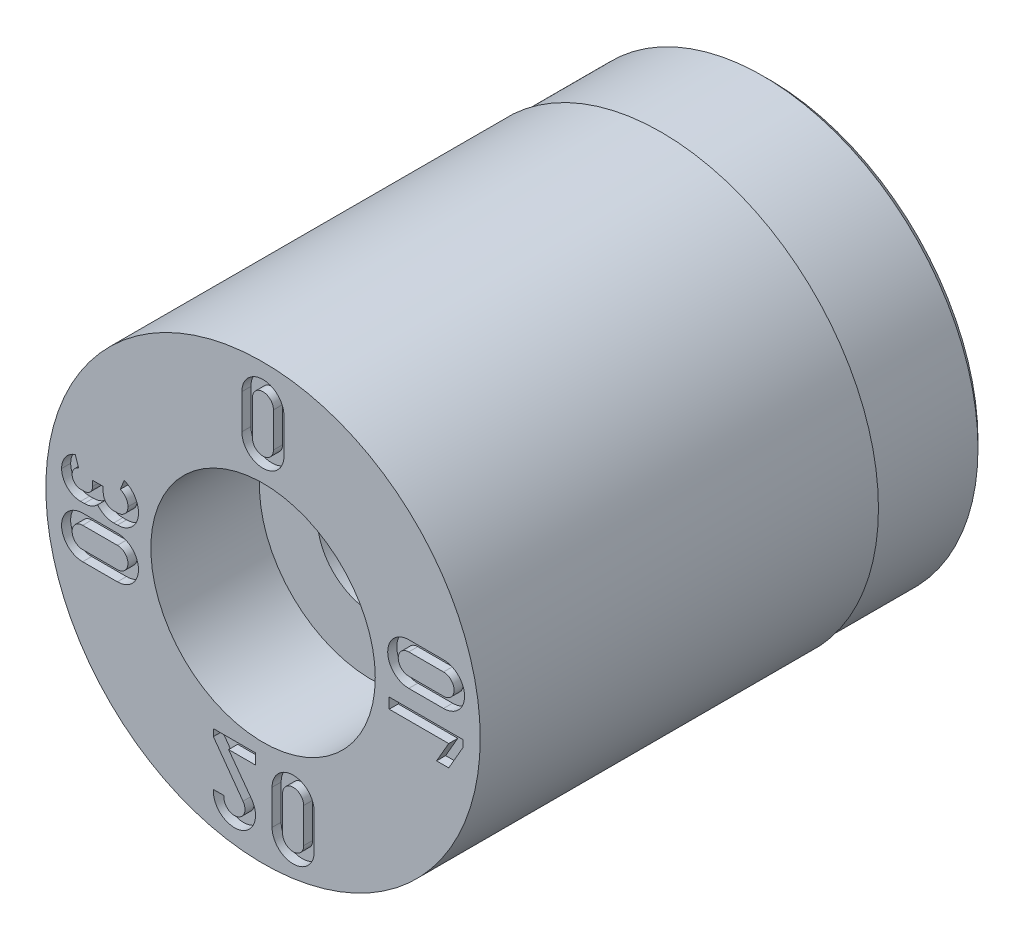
ISO-10303-21;
HEADER;
FILE_DESCRIPTION(('STEP AP214'),'2;1');
FILE_NAME('part.step','',(''),(''),'','','');
FILE_SCHEMA(('AUTOMOTIVE_DESIGN { 1 0 10303 214 1 1 1 1 }'));
ENDSEC;
DATA;
#1=APPLICATION_CONTEXT('core data for automotive mechanical design processes');
#2=APPLICATION_PROTOCOL_DEFINITION('international standard','automotive_design',2000,#1);
#3=PRODUCT_CONTEXT('',#1,'mechanical');
#4=PRODUCT('Part','Part','',(#3));
#5=PRODUCT_RELATED_PRODUCT_CATEGORY('part','',(#4));
#6=PRODUCT_DEFINITION_FORMATION('','',#4);
#7=PRODUCT_DEFINITION_CONTEXT('part definition',#1,'design');
#8=PRODUCT_DEFINITION('design','',#6,#7);
#9=PRODUCT_DEFINITION_SHAPE('','',#8);
#10=(LENGTH_UNIT() NAMED_UNIT(*) SI_UNIT(.MILLI.,.METRE.));
#11=(NAMED_UNIT(*) PLANE_ANGLE_UNIT() SI_UNIT($,.RADIAN.));
#12=(NAMED_UNIT(*) SI_UNIT($,.STERADIAN.) SOLID_ANGLE_UNIT());
#13=UNCERTAINTY_MEASURE_WITH_UNIT(LENGTH_MEASURE(1.E-05),#10,'distance_accuracy_value','');
#14=(GEOMETRIC_REPRESENTATION_CONTEXT(3) GLOBAL_UNCERTAINTY_ASSIGNED_CONTEXT((#13)) GLOBAL_UNIT_ASSIGNED_CONTEXT((#10,
#11,#12)) REPRESENTATION_CONTEXT('',''));
#15=CARTESIAN_POINT('',(0.,0.,0.));
#16=DIRECTION('',(0.,0.,1.));
#17=DIRECTION('',(1.,0.,0.));
#18=AXIS2_PLACEMENT_3D('',#15,#16,#17);
#19=CARTESIAN_POINT('',(0.,0.,3.79790950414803));
#20=DIRECTION('',(0.,0.,1.));
#21=DIRECTION('',(1.,0.,0.));
#22=AXIS2_PLACEMENT_3D('',#19,#20,#21);
#23=CYLINDRICAL_SURFACE('',#22,6.);
#24=CARTESIAN_POINT('',(0.,0.,0.));
#25=DIRECTION('',(0.,0.,1.));
#26=DIRECTION('',(1.,0.,0.));
#27=AXIS2_PLACEMENT_3D('',#24,#25,#26);
#28=CIRCLE('',#27,6.);
#29=CARTESIAN_POINT('',(6.,0.,0.));
#30=VERTEX_POINT('',#29);
#31=EDGE_CURVE('E11',#30,#30,#28,.T.);
#32=ORIENTED_EDGE('',*,*,#31,.F.);
#33=EDGE_LOOP('',(#32));
#34=FACE_BOUND('',#33,.T.);
#35=CARTESIAN_POINT('',(0.,0.,-11.));
#36=DIRECTION('',(0.,0.,-1.));
#37=DIRECTION('',(-1.,0.,0.));
#38=AXIS2_PLACEMENT_3D('',#35,#36,#37);
#39=CIRCLE('',#38,6.);
#40=CARTESIAN_POINT('',(-6.,0.,-11.));
#41=VERTEX_POINT('',#40);
#42=EDGE_CURVE('E37',#41,#41,#39,.T.);
#43=ORIENTED_EDGE('',*,*,#42,.F.);
#44=EDGE_LOOP('',(#43));
#45=FACE_BOUND('',#44,.T.);
#46=ADVANCED_FACE('F34',(#34,#45),#23,.T.);
#47=CARTESIAN_POINT('',(0.,0.,-14.));
#48=DIRECTION('',(0.,0.,1.));
#49=DIRECTION('',(1.,0.,0.));
#50=AXIS2_PLACEMENT_3D('',#47,#48,#49);
#51=CONICAL_SURFACE('',#50,5.7499999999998,0.785398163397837);
#52=CARTESIAN_POINT('',(0.,0.,-14.));
#53=DIRECTION('',(0.,0.,1.));
#54=DIRECTION('',(1.,0.,0.));
#55=AXIS2_PLACEMENT_3D('',#52,#53,#54);
#56=CIRCLE('',#55,5.7499999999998);
#57=CARTESIAN_POINT('',(5.7499999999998,0.,-14.));
#58=VERTEX_POINT('',#57);
#59=EDGE_CURVE('E1032',#58,#58,#56,.T.);
#60=ORIENTED_EDGE('',*,*,#59,.T.);
#61=EDGE_LOOP('',(#60));
#62=FACE_BOUND('',#61,.T.);
#63=CARTESIAN_POINT('',(0.,0.,-13.8149999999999));
#64=DIRECTION('',(0.,0.,1.));
#65=DIRECTION('',(1.,0.,0.));
#66=AXIS2_PLACEMENT_3D('',#63,#64,#65);
#67=CIRCLE('',#66,5.935);
#68=CARTESIAN_POINT('',(5.935,0.,-13.8149999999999));
#69=VERTEX_POINT('',#68);
#70=EDGE_CURVE('E1031',#69,#69,#67,.T.);
#71=ORIENTED_EDGE('',*,*,#70,.F.);
#72=EDGE_LOOP('',(#71));
#73=FACE_BOUND('',#72,.T.);
#74=ADVANCED_FACE('F1054',(#62,#73),#51,.T.);
#75=CARTESIAN_POINT('',(0.,6.,0.));
#76=DIRECTION('',(0.,0.,-1.));
#77=DIRECTION('',(-1.,0.,0.));
#78=AXIS2_PLACEMENT_3D('',#75,#76,#77);
#79=PLANE('',#78);
#80=DIRECTION('',(0.999999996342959,-8.55224061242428E-05,0.));
#81=VECTOR('',#80,1.);
#82=CARTESIAN_POINT('',(-4.0230608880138,-1.269684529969,0.));
#83=LINE('',#82,#81);
#84=CARTESIAN_POINT('',(-4.98323512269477,-1.26960241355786,0.));
#85=VERTEX_POINT('',#84);
#86=CARTESIAN_POINT('',(-4.0230608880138,-1.269684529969,0.));
#87=VERTEX_POINT('',#86);
#88=EDGE_CURVE('E522',#85,#87,#83,.T.);
#89=ORIENTED_EDGE('',*,*,#88,.F.);
#90=CARTESIAN_POINT('',(-4.98318534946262,-0.687603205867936,0.));
#91=DIRECTION('',(0.,0.,1.));
#92=DIRECTION('',(1.,0.,0.));
#93=AXIS2_PLACEMENT_3D('',#90,#91,#92);
#94=CIRCLE('',#93,0.581999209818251);
#95=CARTESIAN_POINT('',(-4.98313557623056,-0.105603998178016,0.));
#96=VERTEX_POINT('',#95);
#97=EDGE_CURVE('E50',#96,#85,#94,.T.);
#98=ORIENTED_EDGE('',*,*,#97,.F.);
#99=DIRECTION('',(-0.999999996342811,8.55241324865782E-05,0.));
#100=VECTOR('',#99,1.);
#101=CARTESIAN_POINT('',(-4.98313557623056,-0.105603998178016,0.));
#102=LINE('',#101,#100);
#103=CARTESIAN_POINT('',(-4.02299079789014,-0.105686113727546,0.));
#104=VERTEX_POINT('',#103);
#105=EDGE_CURVE('E511',#104,#96,#102,.T.);
#106=ORIENTED_EDGE('',*,*,#105,.F.);
#107=CARTESIAN_POINT('',(-4.02302289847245,-0.687685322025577,0.));
#108=DIRECTION('',(0.,0.,1.));
#109=DIRECTION('',(1.,0.,0.));
#110=AXIS2_PLACEMENT_3D('',#107,#108,#109);
#111=CIRCLE('',#110,0.581999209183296);
#112=EDGE_CURVE('E525',#87,#104,#111,.T.);
#113=ORIENTED_EDGE('',*,*,#112,.F.);
#114=EDGE_LOOP('',(#89,#98,#106,#113));
#115=FACE_BOUND('',#114,.T.);
#116=DIRECTION('',(8.43544746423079E-05,-0.999999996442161,0.));
#117=VECTOR('',#116,1.);
#118=CARTESIAN_POINT('',(-0.585457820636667,4.99868740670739,0.));
#119=LINE('',#118,#117);
#120=CARTESIAN_POINT('',(-0.585457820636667,4.99868740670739,0.));
#121=VERTEX_POINT('',#120);
#122=CARTESIAN_POINT('',(-0.585376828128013,4.03854262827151,0.));
#123=VERTEX_POINT('',#122);
#124=EDGE_CURVE('E586',#121,#123,#119,.T.);
#125=ORIENTED_EDGE('',*,*,#124,.F.);
#126=CARTESIAN_POINT('',(-0.0033771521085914,4.99873650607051,0.));
#127=DIRECTION('',(0.,0.,1.));
#128=DIRECTION('',(1.,0.,0.));
#129=AXIS2_PLACEMENT_3D('',#126,#127,#128);
#130=CIRCLE('',#129,0.582080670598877);
#131=CARTESIAN_POINT('',(0.578703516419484,4.99878560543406,0.));
#132=VERTEX_POINT('',#131);
#133=EDGE_CURVE('E564',#132,#121,#130,.T.);
#134=ORIENTED_EDGE('',*,*,#133,.F.);
#135=DIRECTION('',(8.53287261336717E-05,0.999999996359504,0.));
#136=VECTOR('',#135,1.);
#137=CARTESIAN_POINT('',(0.578621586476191,4.03861724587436,0.));
#138=LINE('',#137,#136);
#139=CARTESIAN_POINT('',(0.578621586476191,4.03861724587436,0.));
#140=VERTEX_POINT('',#139);
#141=EDGE_CURVE('E575',#140,#132,#138,.T.);
#142=ORIENTED_EDGE('',*,*,#141,.F.);
#143=CARTESIAN_POINT('',(-0.00337762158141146,4.03859172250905,0.));
#144=DIRECTION('',(0.,0.,1.));
#145=DIRECTION('',(1.,0.,0.));
#146=AXIS2_PLACEMENT_3D('',#143,#144,#145);
#147=CIRCLE('',#146,0.581999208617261);
#148=EDGE_CURVE('E589',#123,#140,#147,.T.);
#149=ORIENTED_EDGE('',*,*,#148,.F.);
#150=EDGE_LOOP('',(#125,#134,#142,#149));
#151=FACE_BOUND('',#150,.T.);
#152=DIRECTION('',(-8.4351476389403E-05,0.999999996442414,0.));
#153=VECTOR('',#152,1.);
#154=CARTESIAN_POINT('',(-0.208267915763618,-3.74605076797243,0.));
#155=LINE('',#154,#153);
#156=CARTESIAN_POINT('',(-0.208267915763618,-3.74605076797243,0.));
#157=VERTEX_POINT('',#156);
#158=CARTESIAN_POINT('',(-0.208292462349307,-3.45504714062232,0.));
#159=VERTEX_POINT('',#158);
#160=EDGE_CURVE('E633',#157,#159,#155,.T.);
#161=ORIENTED_EDGE('',*,*,#160,.F.);
#162=DIRECTION('',(0.999999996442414,8.43514759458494E-05,0.));
#163=VECTOR('',#162,1.);
#164=CARTESIAN_POINT('',(-0.950268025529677,-3.74611335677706,0.));
#165=LINE('',#164,#163);
#166=CARTESIAN_POINT('',(-0.950268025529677,-3.74611335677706,0.));
#167=VERTEX_POINT('',#166);
#168=EDGE_CURVE('E596',#167,#157,#165,.T.);
#169=ORIENTED_EDGE('',*,*,#168,.F.);
#170=DIRECTION('',(-0.589622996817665,0.80767860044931,0.));
#171=VECTOR('',#170,1.);
#172=CARTESIAN_POINT('',(-0.317384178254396,-4.61305162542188,0.));
#173=LINE('',#172,#171);
#174=CARTESIAN_POINT('',(-0.317384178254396,-4.61305162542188,0.));
#175=VERTEX_POINT('',#174);
#176=EDGE_CURVE('E607',#175,#167,#173,.T.);
#177=ORIENTED_EDGE('',*,*,#176,.F.);
#178=CARTESIAN_POINT('',(-0.789834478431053,-4.95319064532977,0.));
#179=DIRECTION('',(0.,0.,1.));
#180=DIRECTION('',(1.,0.,0.));
#181=AXIS2_PLACEMENT_3D('',#178,#179,#180);
#182=CIRCLE('',#181,0.582154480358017);
#183=CARTESIAN_POINT('',(-1.37037703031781,-4.90989879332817,0.));
#184=VERTEX_POINT('',#183);
#185=EDGE_CURVE('E651',#184,#175,#182,.T.);
#186=ORIENTED_EDGE('',*,*,#185,.F.);
#187=DIRECTION('',(-0.999999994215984,-0.000107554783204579,0.));
#188=VECTOR('',#187,1.);
#189=CARTESIAN_POINT('',(-1.07772324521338,-4.90986731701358,0.));
#190=LINE('',#189,#188);
#191=CARTESIAN_POINT('',(-1.07772324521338,-4.90986731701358,0.));
#192=VERTEX_POINT('',#191);
#193=EDGE_CURVE('E648',#192,#184,#190,.T.);
#194=ORIENTED_EDGE('',*,*,#193,.F.);
#195=CARTESIAN_POINT('',(-0.789981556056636,-4.95351005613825,0.));
#196=DIRECTION('',(0.,0.,-1.));
#197=DIRECTION('',(1.,0.,0.));
#198=AXIS2_PLACEMENT_3D('',#195,#196,#197);
#199=CIRCLE('',#198,0.291032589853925);
#200=CARTESIAN_POINT('',(-0.553845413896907,-4.7833933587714,0.));
#201=VERTEX_POINT('',#200);
#202=EDGE_CURVE('E645',#201,#192,#199,.T.);
#203=ORIENTED_EDGE('',*,*,#202,.F.);
#204=DIRECTION('',(0.584527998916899,-0.811373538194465,0.));
#205=VECTOR('',#204,1.);
#206=CARTESIAN_POINT('',(-1.37211284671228,-3.64757002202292,0.));
#207=LINE('',#206,#205);
#208=CARTESIAN_POINT('',(-1.37211284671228,-3.64757002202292,0.));
#209=VERTEX_POINT('',#208);
#210=EDGE_CURVE('E642',#209,#201,#207,.T.);
#211=ORIENTED_EDGE('',*,*,#210,.F.);
#212=DIRECTION('',(8.43514743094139E-05,-0.999999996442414,0.));
#213=VECTOR('',#212,1.);
#214=CARTESIAN_POINT('',(-1.37212907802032,-3.45514531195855,0.));
#215=LINE('',#214,#213);
#216=CARTESIAN_POINT('',(-1.37212907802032,-3.45514531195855,0.));
#217=VERTEX_POINT('',#216);
#218=EDGE_CURVE('E639',#217,#209,#215,.T.);
#219=ORIENTED_EDGE('',*,*,#218,.F.);
#220=DIRECTION('',(-0.999999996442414,-8.43514755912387E-05,0.));
#221=VECTOR('',#220,1.);
#222=CARTESIAN_POINT('',(-0.208292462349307,-3.45504714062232,0.));
#223=LINE('',#222,#221);
#224=EDGE_CURVE('E636',#159,#217,#223,.T.);
#225=ORIENTED_EDGE('',*,*,#224,.F.);
#226=EDGE_LOOP('',(#161,#169,#177,#186,#194,#203,#211,#219,#225));
#227=FACE_BOUND('',#226,.T.);
#228=DIRECTION('',(8.48997848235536E-05,-0.999999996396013,0.));
#229=VECTOR('',#228,1.);
#230=CARTESIAN_POINT('',(3.48525924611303,-0.562576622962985,0.));
#231=LINE('',#230,#229);
#232=CARTESIAN_POINT('',(3.48523454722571,-0.271658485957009,0.));
#233=VERTEX_POINT('',#232);
#234=CARTESIAN_POINT('',(3.48525924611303,-0.562576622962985,0.));
#235=VERTEX_POINT('',#234);
#236=EDGE_CURVE('E699',#233,#235,#231,.T.);
#237=ORIENTED_EDGE('',*,*,#236,.F.);
#238=DIRECTION('',(-0.999999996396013,-8.48997846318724E-05,0.));
#239=VECTOR('',#238,1.);
#240=CARTESIAN_POINT('',(3.48523454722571,-0.271658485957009,0.));
#241=LINE('',#240,#239);
#242=CARTESIAN_POINT('',(5.52190590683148,-0.27148557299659,0.));
#243=VERTEX_POINT('',#242);
#244=EDGE_CURVE('E658',#243,#233,#241,.T.);
#245=ORIENTED_EDGE('',*,*,#244,.F.);
#246=DIRECTION('',(-8.48997827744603E-05,0.999999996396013,0.));
#247=VECTOR('',#246,1.);
#248=CARTESIAN_POINT('',(5.52190590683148,-0.27148557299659,0.));
#249=LINE('',#248,#247);
#250=CARTESIAN_POINT('',(5.52192216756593,-0.463014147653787,0.));
#251=VERTEX_POINT('',#250);
#252=EDGE_CURVE('E679',#251,#243,#249,.T.);
#253=ORIENTED_EDGE('',*,*,#252,.F.);
#254=DIRECTION('',(0.4984189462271,0.866936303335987,0.));
#255=VECTOR('',#254,1.);
#256=CARTESIAN_POINT('',(5.52192216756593,-0.463014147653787,0.));
#257=LINE('',#256,#255);
#258=CARTESIAN_POINT('',(5.13020590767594,-1.1443547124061,0.));
#259=VERTEX_POINT('',#258);
#260=EDGE_CURVE('E711',#259,#251,#257,.T.);
#261=ORIENTED_EDGE('',*,*,#260,.F.);
#262=DIRECTION('',(0.999999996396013,8.4899783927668E-05,0.));
#263=VECTOR('',#262,1.);
#264=CARTESIAN_POINT('',(5.13020590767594,-1.1443547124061,0.));
#265=LINE('',#264,#263);
#266=CARTESIAN_POINT('',(4.79464393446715,-1.14438320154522,0.));
#267=VERTEX_POINT('',#266);
#268=EDGE_CURVE('E708',#267,#259,#265,.T.);
#269=ORIENTED_EDGE('',*,*,#268,.F.);
#270=DIRECTION('',(-0.498285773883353,-0.867012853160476,0.));
#271=VECTOR('',#270,1.);
#272=CARTESIAN_POINT('',(4.79464393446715,-1.14438320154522,0.));
#273=LINE('',#272,#271);
#274=CARTESIAN_POINT('',(5.12909743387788,-0.562437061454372,0.));
#275=VERTEX_POINT('',#274);
#276=EDGE_CURVE('E705',#275,#267,#273,.T.);
#277=ORIENTED_EDGE('',*,*,#276,.F.);
#278=DIRECTION('',(0.999999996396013,8.48997846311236E-05,0.));
#279=VECTOR('',#278,1.);
#280=CARTESIAN_POINT('',(5.12909743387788,-0.562437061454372,0.));
#281=LINE('',#280,#279);
#282=EDGE_CURVE('E702',#235,#275,#281,.T.);
#283=ORIENTED_EDGE('',*,*,#282,.F.);
#284=EDGE_LOOP('',(#237,#245,#253,#261,#269,#277,#283));
#285=FACE_BOUND('',#284,.T.);
#286=DIRECTION('',(-0.999999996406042,8.47815831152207E-05,0.));
#287=VECTOR('',#286,1.);
#288=CARTESIAN_POINT('',(4.98556535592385,1.36923003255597,0.));
#289=LINE('',#288,#287);
#290=CARTESIAN_POINT('',(4.98556535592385,1.36923003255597,0.));
#291=VERTEX_POINT('',#290);
#292=CARTESIAN_POINT('',(4.02542056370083,1.36931143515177,0.));
#293=VERTEX_POINT('',#292);
#294=EDGE_CURVE('E779',#291,#293,#289,.T.);
#295=ORIENTED_EDGE('',*,*,#294,.F.);
#296=CARTESIAN_POINT('',(4.98561476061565,0.787312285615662,0.));
#297=DIRECTION('',(0.,0.,1.));
#298=DIRECTION('',(1.,0.,0.));
#299=AXIS2_PLACEMENT_3D('',#296,#297,#298);
#300=CIRCLE('',#299,0.581917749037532);
#301=CARTESIAN_POINT('',(4.98566416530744,0.205394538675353,0.));
#302=VERTEX_POINT('',#301);
#303=EDGE_CURVE('E757',#302,#291,#300,.T.);
#304=ORIENTED_EDGE('',*,*,#303,.F.);
#305=DIRECTION('',(0.999999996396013,8.48997850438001E-05,0.));
#306=VECTOR('',#305,1.);
#307=CARTESIAN_POINT('',(4.02549581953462,0.205313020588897,0.));
#308=LINE('',#307,#306);
#309=CARTESIAN_POINT('',(4.02549581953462,0.205313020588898,0.));
#310=VERTEX_POINT('',#309);
#311=EDGE_CURVE('E768',#310,#302,#308,.T.);
#312=ORIENTED_EDGE('',*,*,#311,.F.);
#313=CARTESIAN_POINT('',(4.02546997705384,0.787312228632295,0.));
#314=DIRECTION('',(0.,0.,1.));
#315=DIRECTION('',(1.,0.,0.));
#316=AXIS2_PLACEMENT_3D('',#313,#314,#315);
#317=CIRCLE('',#316,0.581999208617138);
#318=EDGE_CURVE('E782',#293,#310,#317,.T.);
#319=ORIENTED_EDGE('',*,*,#318,.F.);
#320=EDGE_LOOP('',(#295,#304,#312,#319));
#321=FACE_BOUND('',#320,.T.);
#322=DIRECTION('',(-0.999999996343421,8.55170029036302E-05,0.));
#323=VECTOR('',#322,1.);
#324=CARTESIAN_POINT('',(-4.02228644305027,0.379630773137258,0.));
#325=LINE('',#324,#323);
#326=CARTESIAN_POINT('',(-4.02228644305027,0.379630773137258,0.));
#327=VERTEX_POINT('',#326);
#328=CARTESIAN_POINT('',(-4.1241225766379,0.37963948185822,0.));
#329=VERTEX_POINT('',#328);
#330=EDGE_CURVE('E862',#327,#329,#325,.T.);
#331=ORIENTED_EDGE('',*,*,#330,.F.);
#332=CARTESIAN_POINT('',(-4.02226156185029,0.67058110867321,0.));
#333=DIRECTION('',(0.,0.,-1.));
#334=DIRECTION('',(1.,0.,0.));
#335=AXIS2_PLACEMENT_3D('',#332,#333,#334);
#336=CIRCLE('',#335,0.290950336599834);
#337=CARTESIAN_POINT('',(-3.73131122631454,0.670556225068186,0.));
#338=VERTEX_POINT('',#337);
#339=EDGE_CURVE('E789',#338,#327,#336,.T.);
#340=ORIENTED_EDGE('',*,*,#339,.F.);
#341=CARTESIAN_POINT('',(-4.06597292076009,0.670584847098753,0.));
#342=DIRECTION('',(0.,0.,-1.));
#343=DIRECTION('',(1.,0.,0.));
#344=AXIS2_PLACEMENT_3D('',#341,#342,#343);
#345=CIRCLE('',#344,0.334661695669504);
#346=CARTESIAN_POINT('',(-3.94311444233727,0.981879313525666,0.));
#347=VERTEX_POINT('',#346);
#348=EDGE_CURVE('E800',#347,#338,#345,.T.);
#349=ORIENTED_EDGE('',*,*,#348,.F.);
#350=DIRECTION('',(-0.367087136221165,-0.930186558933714,0.));
#351=VECTOR('',#350,1.);
#352=CARTESIAN_POINT('',(-3.83633570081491,1.25245308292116,0.));
#353=LINE('',#352,#351);
#354=CARTESIAN_POINT('',(-3.83633570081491,1.25245308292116,0.));
#355=VERTEX_POINT('',#354);
#356=EDGE_CURVE('E916',#355,#347,#353,.T.);
#357=ORIENTED_EDGE('',*,*,#356,.F.);
#358=CARTESIAN_POINT('',(-4.06611554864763,0.670448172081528,0.));
#359=DIRECTION('',(0.,0.,1.));
#360=DIRECTION('',(1.,0.,0.));
#361=AXIS2_PLACEMENT_3D('',#358,#359,#360);
#362=CIRCLE('',#361,0.625722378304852);
#363=CARTESIAN_POINT('',(-3.4403931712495,0.670481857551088,0.));
#364=VERTEX_POINT('',#363);
#365=EDGE_CURVE('E913',#364,#355,#362,.T.);
#366=ORIENTED_EDGE('',*,*,#365,.F.);
#367=CARTESIAN_POINT('',(-4.0222125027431,0.670450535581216,0.));
#368=DIRECTION('',(0.,0.,1.));
#369=DIRECTION('',(1.,0.,0.));
#370=AXIS2_PLACEMENT_3D('',#367,#368,#369);
#371=CIRCLE('',#370,0.581819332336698);
#372=CARTESIAN_POINT('',(-4.02226210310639,0.0886312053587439,0.));
#373=VERTEX_POINT('',#372);
#374=EDGE_CURVE('E910',#373,#364,#371,.T.);
#375=ORIENTED_EDGE('',*,*,#374,.F.);
#376=DIRECTION('',(0.99999999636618,-8.52504561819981E-05,0.));
#377=VECTOR('',#376,1.);
#378=CARTESIAN_POINT('',(-4.12413553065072,0.0886398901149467,0.));
#379=LINE('',#378,#377);
#380=CARTESIAN_POINT('',(-4.12413553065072,0.0886398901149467,0.));
#381=VERTEX_POINT('',#380);
#382=EDGE_CURVE('E907',#381,#373,#379,.T.);
#383=ORIENTED_EDGE('',*,*,#382,.F.);
#384=CARTESIAN_POINT('',(-4.1242258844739,0.670313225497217,0.));
#385=DIRECTION('',(0.,0.,1.));
#386=DIRECTION('',(1.,0.,0.));
#387=AXIS2_PLACEMENT_3D('',#384,#385,#386);
#388=CIRCLE('',#387,0.581673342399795);
#389=CARTESIAN_POINT('',(-4.5709742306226,0.29780847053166,0.));
#390=VERTEX_POINT('',#389);
#391=EDGE_CURVE('E904',#390,#381,#388,.T.);
#392=ORIENTED_EDGE('',*,*,#391,.F.);
#393=CARTESIAN_POINT('',(-4.93873129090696,0.670377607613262,0.));
#394=DIRECTION('',(0.,0.,1.));
#395=DIRECTION('',(1.,0.,0.));
#396=AXIS2_PLACEMENT_3D('',#393,#394,#395);
#397=CIRCLE('',#396,0.52350073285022);
#398=CARTESIAN_POINT('',(-4.93877626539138,0.146876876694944,0.));
#399=VERTEX_POINT('',#398);
#400=EDGE_CURVE('E901',#399,#390,#397,.T.);
#401=ORIENTED_EDGE('',*,*,#400,.F.);
#402=DIRECTION('',(0.999999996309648,-8.59110265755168E-05,0.));
#403=VECTOR('',#402,1.);
#404=CARTESIAN_POINT('',(-5.04056937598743,0.146885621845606,0.));
#405=LINE('',#404,#403);
#406=CARTESIAN_POINT('',(-5.04056937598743,0.146885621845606,0.));
#407=VERTEX_POINT('',#406);
#408=EDGE_CURVE('E898',#407,#399,#405,.T.);
#409=ORIENTED_EDGE('',*,*,#408,.F.);
#410=CARTESIAN_POINT('',(-5.0406054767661,0.670560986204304,0.));
#411=DIRECTION('',(0.,0.,1.));
#412=DIRECTION('',(1.,0.,0.));
#413=AXIS2_PLACEMENT_3D('',#410,#411,#412);
#414=CIRCLE('',#413,0.523675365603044);
#415=CARTESIAN_POINT('',(-5.56428081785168,0.670721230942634,0.));
#416=VERTEX_POINT('',#415);
#417=EDGE_CURVE('E895',#416,#407,#414,.T.);
#418=ORIENTED_EDGE('',*,*,#417,.F.);
#419=CARTESIAN_POINT('',(-5.01131844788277,0.670552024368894,0.));
#420=DIRECTION('',(0.,0.,1.));
#421=DIRECTION('',(1.,0.,0.));
#422=AXIS2_PLACEMENT_3D('',#419,#420,#421);
#423=CIRCLE('',#422,0.552962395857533);
#424=CARTESIAN_POINT('',(-5.18838259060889,1.1943990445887,0.));
#425=VERTEX_POINT('',#424);
#426=EDGE_CURVE('E892',#425,#416,#423,.T.);
#427=ORIENTED_EDGE('',*,*,#426,.F.);
#428=DIRECTION('',(-0.319923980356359,0.947443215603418,0.));
#429=VECTOR('',#428,1.);
#430=CARTESIAN_POINT('',(-5.09528833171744,0.918703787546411,0.));
#431=LINE('',#430,#429);
#432=CARTESIAN_POINT('',(-5.09528833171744,0.918703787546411,0.));
#433=VERTEX_POINT('',#432);
#434=EDGE_CURVE('E889',#433,#425,#431,.T.);
#435=ORIENTED_EDGE('',*,*,#434,.F.);
#436=CARTESIAN_POINT('',(-5.01180722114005,0.670877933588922,0.));
#437=DIRECTION('',(0.,0.,-1.));
#438=DIRECTION('',(1.,0.,0.));
#439=AXIS2_PLACEMENT_3D('',#436,#437,#438);
#440=CIRCLE('',#439,0.261508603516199);
#441=CARTESIAN_POINT('',(-5.27331572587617,0.670650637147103,0.));
#442=VERTEX_POINT('',#441);
#443=EDGE_CURVE('E886',#442,#433,#440,.T.);
#444=ORIENTED_EDGE('',*,*,#443,.F.);
#445=CARTESIAN_POINT('',(-5.04034778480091,0.670853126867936,0.));
#446=DIRECTION('',(0.,0.,-1.));
#447=DIRECTION('',(1.,0.,0.));
#448=AXIS2_PLACEMENT_3D('',#445,#446,#447);
#449=CIRCLE('',#448,0.232968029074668);
#450=CARTESIAN_POINT('',(-5.04057342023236,0.437885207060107,0.));
#451=VERTEX_POINT('',#450);
#452=EDGE_CURVE('E883',#451,#442,#449,.T.);
#453=ORIENTED_EDGE('',*,*,#452,.F.);
#454=DIRECTION('',(-0.999999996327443,8.57036442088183E-05,0.));
#455=VECTOR('',#454,1.);
#456=CARTESIAN_POINT('',(-4.93875137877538,0.437876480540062,0.));
#457=LINE('',#456,#455);
#458=CARTESIAN_POINT('',(-4.93875137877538,0.437876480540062,0.));
#459=VERTEX_POINT('',#458);
#460=EDGE_CURVE('E880',#459,#451,#457,.T.);
#461=ORIENTED_EDGE('',*,*,#460,.F.);
#462=CARTESIAN_POINT('',(-4.93873143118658,0.670627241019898,0.));
#463=DIRECTION('',(0.,0.,-1.));
#464=DIRECTION('',(1.,0.,0.));
#465=AXIS2_PLACEMENT_3D('',#462,#463,#464);
#466=CIRCLE('',#465,0.232750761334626);
#467=CARTESIAN_POINT('',(-4.70598067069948,0.67060737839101,0.));
#468=VERTEX_POINT('',#467);
#469=EDGE_CURVE('E877',#468,#459,#466,.T.);
#470=ORIENTED_EDGE('',*,*,#469,.F.);
#471=DIRECTION('',(-8.55211336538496E-05,-0.999999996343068,0.));
#472=VECTOR('',#471,1.);
#473=CARTESIAN_POINT('',(-4.70596823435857,0.816025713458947,0.));
#474=LINE('',#473,#472);
#475=CARTESIAN_POINT('',(-4.70596823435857,0.816025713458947,0.));
#476=VERTEX_POINT('',#475);
#477=EDGE_CURVE('E874',#476,#468,#474,.T.);
#478=ORIENTED_EDGE('',*,*,#477,.F.);
#479=DIRECTION('',(-0.999999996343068,8.55211334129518E-05,0.));
#480=VECTOR('',#479,1.);
#481=CARTESIAN_POINT('',(-4.41496863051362,0.816000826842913,0.));
#482=LINE('',#481,#480);
#483=CARTESIAN_POINT('',(-4.41496863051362,0.816000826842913,0.));
#484=VERTEX_POINT('',#483);
#485=EDGE_CURVE('E871',#484,#476,#482,.T.);
#486=ORIENTED_EDGE('',*,*,#485,.F.);
#487=DIRECTION('',(8.5495912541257E-05,0.999999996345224,0.));
#488=VECTOR('',#487,1.);
#489=CARTESIAN_POINT('',(-4.41498106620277,0.670547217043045,0.));
#490=LINE('',#489,#488);
#491=CARTESIAN_POINT('',(-4.41498106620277,0.670547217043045,0.));
#492=VERTEX_POINT('',#491);
#493=EDGE_CURVE('E868',#492,#484,#490,.T.);
#494=ORIENTED_EDGE('',*,*,#493,.F.);
#495=CARTESIAN_POINT('',(-4.12409820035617,0.670522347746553,0.));
#496=DIRECTION('',(0.,0.,-1.));
#497=DIRECTION('',(1.,0.,0.));
#498=AXIS2_PLACEMENT_3D('',#495,#496,#497);
#499=CIRCLE('',#498,0.290882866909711);
#500=EDGE_CURVE('E865',#329,#492,#499,.T.);
#501=ORIENTED_EDGE('',*,*,#500,.F.);
#502=EDGE_LOOP('',(#331,#340,#349,#357,#366,#375,#383,#392,#401,#409,#418,#427,#435,#444,#453,
#461,#470,#478,#486,#494,#501));
#503=FACE_BOUND('',#502,.T.);
#504=DIRECTION('',(8.53270660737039E-05,0.999999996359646,0.));
#505=VECTOR('',#504,1.);
#506=CARTESIAN_POINT('',(1.4137442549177,-5.00853386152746,0.));
#507=LINE('',#506,#505);
#508=CARTESIAN_POINT('',(1.4137442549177,-5.00853386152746,0.));
#509=VERTEX_POINT('',#508);
#510=CARTESIAN_POINT('',(1.41382618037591,-4.04839938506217,0.));
#511=VERTEX_POINT('',#510);
#512=EDGE_CURVE('E1012',#509,#511,#507,.T.);
#513=ORIENTED_EDGE('',*,*,#512,.F.);
#514=CARTESIAN_POINT('',(0.831745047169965,-5.00858295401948,0.));
#515=DIRECTION('',(0.,0.,1.));
#516=DIRECTION('',(1.,0.,0.));
#517=AXIS2_PLACEMENT_3D('',#514,#515,#516);
#518=CIRCLE('',#517,0.581999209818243);
#519=CARTESIAN_POINT('',(0.249745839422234,-5.00863204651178,0.));
#520=VERTEX_POINT('',#519);
#521=EDGE_CURVE('E990',#520,#509,#518,.T.);
#522=ORIENTED_EDGE('',*,*,#521,.F.);
#523=DIRECTION('',(8.4351475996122E-05,-0.999999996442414,0.));
#524=VECTOR('',#523,1.);
#525=CARTESIAN_POINT('',(0.249664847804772,-4.04846370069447,0.));
#526=LINE('',#525,#524);
#527=CARTESIAN_POINT('',(0.249664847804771,-4.04846370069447,0.));
#528=VERTEX_POINT('',#527);
#529=EDGE_CURVE('E1001',#528,#520,#526,.T.);
#530=ORIENTED_EDGE('',*,*,#529,.F.);
#531=CARTESIAN_POINT('',(0.831745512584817,-4.04840429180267,0.));
#532=DIRECTION('',(0.,0.,1.));
#533=DIRECTION('',(1.,0.,0.));
#534=AXIS2_PLACEMENT_3D('',#531,#532,#533);
#535=CIRCLE('',#534,0.58208066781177);
#536=EDGE_CURVE('E1015',#511,#528,#535,.T.);
#537=ORIENTED_EDGE('',*,*,#536,.F.);
#538=EDGE_LOOP('',(#513,#522,#530,#537));
#539=FACE_BOUND('',#538,.T.);
#540=CARTESIAN_POINT('',(0.,0.,0.));
#541=DIRECTION('',(0.,0.,1.));
#542=DIRECTION('',(1.,0.,0.));
#543=AXIS2_PLACEMENT_3D('',#540,#541,#542);
#544=CIRCLE('',#543,3.1);
#545=CARTESIAN_POINT('',(3.1,0.,0.));
#546=VERTEX_POINT('',#545);
#547=EDGE_CURVE('E42',#546,#546,#544,.T.);
#548=ORIENTED_EDGE('',*,*,#547,.F.);
#549=EDGE_LOOP('',(#548));
#550=FACE_BOUND('',#549,.T.);
#551=ORIENTED_EDGE('',*,*,#31,.T.);
#552=EDGE_LOOP('',(#551));
#553=FACE_BOUND('',#552,.T.);
#554=ADVANCED_FACE('F1059',(#115,#151,#227,#285,#321,#503,#539,#550,#553),#79,.F.);
#555=CARTESIAN_POINT('',(0.,0.,3.79790950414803));
#556=DIRECTION('',(0.,0.,1.));
#557=DIRECTION('',(1.,0.,0.));
#558=AXIS2_PLACEMENT_3D('',#555,#556,#557);
#559=CYLINDRICAL_SURFACE('',#558,3.1);
#560=CARTESIAN_POINT('',(0.,0.,-3.));
#561=DIRECTION('',(0.,0.,1.));
#562=DIRECTION('',(1.,0.,0.));
#563=AXIS2_PLACEMENT_3D('',#560,#561,#562);
#564=CIRCLE('',#563,3.1);
#565=CARTESIAN_POINT('',(3.1,0.,-3.));
#566=VERTEX_POINT('',#565);
#567=EDGE_CURVE('E1041',#566,#566,#564,.T.);
#568=ORIENTED_EDGE('',*,*,#567,.F.);
#569=EDGE_LOOP('',(#568));
#570=FACE_BOUND('',#569,.T.);
#571=ORIENTED_EDGE('',*,*,#547,.T.);
#572=EDGE_LOOP('',(#571));
#573=FACE_BOUND('',#572,.T.);
#574=ADVANCED_FACE('F1065',(#570,#573),#559,.F.);
#575=CARTESIAN_POINT('',(0.,3.1,-3.));
#576=DIRECTION('',(0.,0.,-1.));
#577=DIRECTION('',(-1.,0.,0.));
#578=AXIS2_PLACEMENT_3D('',#575,#576,#577);
#579=PLANE('',#578);
#580=CARTESIAN_POINT('',(0.,0.,-3.));
#581=DIRECTION('',(0.,0.,1.));
#582=DIRECTION('',(1.,0.,0.));
#583=AXIS2_PLACEMENT_3D('',#580,#581,#582);
#584=CIRCLE('',#583,1.5);
#585=CARTESIAN_POINT('',(1.5,0.,-3.));
#586=VERTEX_POINT('',#585);
#587=EDGE_CURVE('E1038',#586,#586,#584,.T.);
#588=ORIENTED_EDGE('',*,*,#587,.F.);
#589=EDGE_LOOP('',(#588));
#590=FACE_BOUND('',#589,.T.);
#591=ORIENTED_EDGE('',*,*,#567,.T.);
#592=EDGE_LOOP('',(#591));
#593=FACE_BOUND('',#592,.T.);
#594=ADVANCED_FACE('F1072',(#590,#593),#579,.F.);
#595=CARTESIAN_POINT('',(0.,0.,3.79790950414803));
#596=DIRECTION('',(0.,0.,1.));
#597=DIRECTION('',(1.,0.,0.));
#598=AXIS2_PLACEMENT_3D('',#595,#596,#597);
#599=CYLINDRICAL_SURFACE('',#598,1.5);
#600=CARTESIAN_POINT('',(0.,0.,-14.));
#601=DIRECTION('',(0.,0.,1.));
#602=DIRECTION('',(1.,0.,0.));
#603=AXIS2_PLACEMENT_3D('',#600,#601,#602);
#604=CIRCLE('',#603,1.5);
#605=CARTESIAN_POINT('',(1.5,0.,-14.));
#606=VERTEX_POINT('',#605);
#607=EDGE_CURVE('E1035',#606,#606,#604,.T.);
#608=ORIENTED_EDGE('',*,*,#607,.F.);
#609=EDGE_LOOP('',(#608));
#610=FACE_BOUND('',#609,.T.);
#611=ORIENTED_EDGE('',*,*,#587,.T.);
#612=EDGE_LOOP('',(#611));
#613=FACE_BOUND('',#612,.T.);
#614=ADVANCED_FACE('F1223',(#610,#613),#599,.F.);
#615=CARTESIAN_POINT('',(0.,1.5,-14.));
#616=DIRECTION('',(0.,0.,1.));
#617=DIRECTION('',(1.,0.,0.));
#618=AXIS2_PLACEMENT_3D('',#615,#616,#617);
#619=PLANE('',#618);
#620=ORIENTED_EDGE('',*,*,#59,.F.);
#621=EDGE_LOOP('',(#620));
#622=FACE_BOUND('',#621,.T.);
#623=ORIENTED_EDGE('',*,*,#607,.T.);
#624=EDGE_LOOP('',(#623));
#625=FACE_BOUND('',#624,.T.);
#626=ADVANCED_FACE('F1218',(#622,#625),#619,.F.);
#627=CARTESIAN_POINT('',(0.,6.935,-11.));
#628=DIRECTION('',(0.,0.,-1.));
#629=DIRECTION('',(-1.,0.,0.));
#630=AXIS2_PLACEMENT_3D('',#627,#628,#629);
#631=PLANE('',#630);
#632=CARTESIAN_POINT('',(0.,0.,-11.));
#633=DIRECTION('',(0.,0.,1.));
#634=DIRECTION('',(1.,0.,0.));
#635=AXIS2_PLACEMENT_3D('',#632,#633,#634);
#636=CIRCLE('',#635,5.935);
#637=CARTESIAN_POINT('',(5.935,0.,-11.));
#638=VERTEX_POINT('',#637);
#639=EDGE_CURVE('E1022',#638,#638,#636,.T.);
#640=ORIENTED_EDGE('',*,*,#639,.T.);
#641=EDGE_LOOP('',(#640));
#642=FACE_BOUND('',#641,.T.);
#643=ORIENTED_EDGE('',*,*,#42,.T.);
#644=EDGE_LOOP('',(#643));
#645=FACE_BOUND('',#644,.T.);
#646=ADVANCED_FACE('F1051',(#642,#645),#631,.T.);
#647=CARTESIAN_POINT('',(0.,0.,0.));
#648=DIRECTION('',(0.,0.,1.));
#649=DIRECTION('',(1.,0.,0.));
#650=AXIS2_PLACEMENT_3D('',#647,#648,#649);
#651=CYLINDRICAL_SURFACE('',#650,5.935);
#652=ORIENTED_EDGE('',*,*,#639,.F.);
#653=EDGE_LOOP('',(#652));
#654=FACE_BOUND('',#653,.T.);
#655=ORIENTED_EDGE('',*,*,#70,.T.);
#656=EDGE_LOOP('',(#655));
#657=FACE_BOUND('',#656,.T.);
#658=ADVANCED_FACE('F1213',(#654,#657),#651,.T.);
#659=CARTESIAN_POINT('',(0.831745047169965,-5.00858295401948,-0.25));
#660=DIRECTION('',(0.,0.,1.));
#661=DIRECTION('',(1.,0.,0.));
#662=AXIS2_PLACEMENT_3D('',#659,#660,#661);
#663=CYLINDRICAL_SURFACE('',#662,0.581999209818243);
#664=ORIENTED_EDGE('',*,*,#521,.T.);
#665=DIRECTION('',(0.,0.,1.));
#666=VECTOR('',#665,1.);
#667=CARTESIAN_POINT('',(1.4137442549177,-5.00853386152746,-0.25));
#668=LINE('',#667,#666);
#669=CARTESIAN_POINT('',(1.4137442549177,-5.00853386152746,-0.25));
#670=VERTEX_POINT('',#669);
#671=EDGE_CURVE('E1010',#670,#509,#668,.T.);
#672=ORIENTED_EDGE('',*,*,#671,.F.);
#673=CARTESIAN_POINT('',(0.831745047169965,-5.00858295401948,-0.25));
#674=DIRECTION('',(0.,0.,1.));
#675=DIRECTION('',(1.,0.,0.));
#676=AXIS2_PLACEMENT_3D('',#673,#674,#675);
#677=CIRCLE('',#676,0.581999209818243);
#678=CARTESIAN_POINT('',(0.249745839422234,-5.00863204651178,-0.25));
#679=VERTEX_POINT('',#678);
#680=EDGE_CURVE('E997',#679,#670,#677,.T.);
#681=ORIENTED_EDGE('',*,*,#680,.F.);
#682=DIRECTION('',(0.,0.,1.));
#683=VECTOR('',#682,1.);
#684=CARTESIAN_POINT('',(0.249745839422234,-5.00863204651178,-0.25));
#685=LINE('',#684,#683);
#686=EDGE_CURVE('E1020',#679,#520,#685,.T.);
#687=ORIENTED_EDGE('',*,*,#686,.T.);
#688=EDGE_LOOP('',(#664,#672,#681,#687));
#689=FACE_BOUND('',#688,.T.);
#690=ADVANCED_FACE('F1185',(#689),#663,.F.);
#691=CARTESIAN_POINT('',(0.249664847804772,-4.04846370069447,-0.25));
#692=DIRECTION('',(-0.999999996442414,-8.43514759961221E-05,0.));
#693=DIRECTION('',(8.43514759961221E-05,-0.999999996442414,0.));
#694=AXIS2_PLACEMENT_3D('',#691,#692,#693);
#695=PLANE('',#694);
#696=ORIENTED_EDGE('',*,*,#529,.T.);
#697=ORIENTED_EDGE('',*,*,#686,.F.);
#698=DIRECTION('',(8.4351475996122E-05,-0.999999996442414,0.));
#699=VECTOR('',#698,1.);
#700=CARTESIAN_POINT('',(0.249664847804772,-4.04846370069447,-0.25));
#701=LINE('',#700,#699);
#702=CARTESIAN_POINT('',(0.249664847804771,-4.04846370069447,-0.25));
#703=VERTEX_POINT('',#702);
#704=EDGE_CURVE('E1007',#703,#679,#701,.T.);
#705=ORIENTED_EDGE('',*,*,#704,.F.);
#706=DIRECTION('',(0.,0.,1.));
#707=VECTOR('',#706,1.);
#708=CARTESIAN_POINT('',(0.249664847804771,-4.04846370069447,-0.25));
#709=LINE('',#708,#707);
#710=EDGE_CURVE('E1023',#703,#528,#709,.T.);
#711=ORIENTED_EDGE('',*,*,#710,.T.);
#712=EDGE_LOOP('',(#696,#697,#705,#711));
#713=FACE_BOUND('',#712,.T.);
#714=ADVANCED_FACE('F1188',(#713),#695,.F.);
#715=CARTESIAN_POINT('',(0.831745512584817,-4.04840429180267,-0.25));
#716=DIRECTION('',(0.,0.,1.));
#717=DIRECTION('',(1.,0.,0.));
#718=AXIS2_PLACEMENT_3D('',#715,#716,#717);
#719=CYLINDRICAL_SURFACE('',#718,0.58208066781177);
#720=ORIENTED_EDGE('',*,*,#536,.T.);
#721=ORIENTED_EDGE('',*,*,#710,.F.);
#722=CARTESIAN_POINT('',(0.831745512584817,-4.04840429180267,-0.25));
#723=DIRECTION('',(0.,0.,1.));
#724=DIRECTION('',(1.,0.,0.));
#725=AXIS2_PLACEMENT_3D('',#722,#723,#724);
#726=CIRCLE('',#725,0.58208066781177);
#727=CARTESIAN_POINT('',(1.41382618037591,-4.04839938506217,-0.25));
#728=VERTEX_POINT('',#727);
#729=EDGE_CURVE('E1004',#728,#703,#726,.T.);
#730=ORIENTED_EDGE('',*,*,#729,.F.);
#731=DIRECTION('',(0.,0.,1.));
#732=VECTOR('',#731,1.);
#733=CARTESIAN_POINT('',(1.41382618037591,-4.04839938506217,-0.25));
#734=LINE('',#733,#732);
#735=EDGE_CURVE('E1025',#728,#511,#734,.T.);
#736=ORIENTED_EDGE('',*,*,#735,.T.);
#737=EDGE_LOOP('',(#720,#721,#730,#736));
#738=FACE_BOUND('',#737,.T.);
#739=ADVANCED_FACE('F1190',(#738),#719,.F.);
#740=CARTESIAN_POINT('',(1.4137442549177,-5.00853386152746,-0.25));
#741=DIRECTION('',(0.999999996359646,-8.53270660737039E-05,0.));
#742=DIRECTION('',(8.53270660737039E-05,0.999999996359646,0.));
#743=AXIS2_PLACEMENT_3D('',#740,#741,#742);
#744=PLANE('',#743);
#745=ORIENTED_EDGE('',*,*,#512,.T.);
#746=ORIENTED_EDGE('',*,*,#735,.F.);
#747=DIRECTION('',(8.53270660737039E-05,0.999999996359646,0.));
#748=VECTOR('',#747,1.);
#749=CARTESIAN_POINT('',(1.4137442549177,-5.00853386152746,-0.25));
#750=LINE('',#749,#748);
#751=EDGE_CURVE('E1000',#670,#728,#750,.T.);
#752=ORIENTED_EDGE('',*,*,#751,.F.);
#753=ORIENTED_EDGE('',*,*,#671,.T.);
#754=EDGE_LOOP('',(#745,#746,#752,#753));
#755=FACE_BOUND('',#754,.T.);
#756=ADVANCED_FACE('F1180',(#755),#744,.F.);
#757=CARTESIAN_POINT('',(0.831745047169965,-5.00858295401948,-0.25));
#758=DIRECTION('',(0.,0.,1.));
#759=DIRECTION('',(1.,0.,0.));
#760=AXIS2_PLACEMENT_3D('',#757,#758,#759);
#761=PLANE('',#760);
#762=DIRECTION('',(8.53190860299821E-05,0.999999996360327,0.));
#763=VECTOR('',#762,1.);
#764=CARTESIAN_POINT('',(1.12266318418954,-5.00855841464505,-0.25));
#765=LINE('',#764,#763);
#766=CARTESIAN_POINT('',(1.12266318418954,-5.00855841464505,-0.25));
#767=VERTEX_POINT('',#766);
#768=CARTESIAN_POINT('',(1.12274510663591,-4.0483694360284,-0.25));
#769=VERTEX_POINT('',#768);
#770=EDGE_CURVE('E974',#767,#769,#765,.T.);
#771=ORIENTED_EDGE('',*,*,#770,.F.);
#772=CARTESIAN_POINT('',(0.831745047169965,-5.00858295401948,-0.25));
#773=DIRECTION('',(0.,0.,1.));
#774=DIRECTION('',(1.,0.,0.));
#775=AXIS2_PLACEMENT_3D('',#772,#773,#774);
#776=CIRCLE('',#775,0.290918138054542);
#777=CARTESIAN_POINT('',(0.540826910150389,-5.00860749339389,-0.25));
#778=VERTEX_POINT('',#777);
#779=EDGE_CURVE('E971',#778,#767,#776,.T.);
#780=ORIENTED_EDGE('',*,*,#779,.F.);
#781=DIRECTION('',(8.43514751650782E-05,-0.999999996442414,0.));
#782=VECTOR('',#781,1.);
#783=CARTESIAN_POINT('',(0.540745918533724,-4.04843914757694,-0.25));
#784=LINE('',#783,#782);
#785=CARTESIAN_POINT('',(0.540745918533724,-4.04843914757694,-0.25));
#786=VERTEX_POINT('',#785);
#787=EDGE_CURVE('E967',#786,#778,#784,.T.);
#788=ORIENTED_EDGE('',*,*,#787,.F.);
#789=CARTESIAN_POINT('',(0.831745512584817,-4.04840429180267,-0.25));
#790=DIRECTION('',(0.,0.,1.));
#791=DIRECTION('',(1.,0.,0.));
#792=AXIS2_PLACEMENT_3D('',#789,#790,#791);
#793=CIRCLE('',#792,0.290999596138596);
#794=EDGE_CURVE('E964',#769,#786,#793,.T.);
#795=ORIENTED_EDGE('',*,*,#794,.F.);
#796=EDGE_LOOP('',(#771,#780,#788,#795));
#797=FACE_BOUND('',#796,.T.);
#798=ORIENTED_EDGE('',*,*,#680,.T.);
#799=ORIENTED_EDGE('',*,*,#751,.T.);
#800=ORIENTED_EDGE('',*,*,#729,.T.);
#801=ORIENTED_EDGE('',*,*,#704,.T.);
#802=EDGE_LOOP('',(#798,#799,#800,#801));
#803=FACE_BOUND('',#802,.T.);
#804=ADVANCED_FACE('F1192',(#797,#803),#761,.T.);
#805=CARTESIAN_POINT('',(0.831745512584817,-4.04840429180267,-0.25));
#806=DIRECTION('',(0.,0.,1.));
#807=DIRECTION('',(1.,0.,0.));
#808=AXIS2_PLACEMENT_3D('',#805,#806,#807);
#809=CYLINDRICAL_SURFACE('',#808,0.290999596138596);
#810=CARTESIAN_POINT('',(0.831745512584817,-4.04840429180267,0.));
#811=DIRECTION('',(0.,0.,1.));
#812=DIRECTION('',(1.,0.,0.));
#813=AXIS2_PLACEMENT_3D('',#810,#811,#812);
#814=CIRCLE('',#813,0.290999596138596);
#815=CARTESIAN_POINT('',(1.12274510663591,-4.0483694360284,0.));
#816=VERTEX_POINT('',#815);
#817=CARTESIAN_POINT('',(0.540745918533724,-4.04843914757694,0.));
#818=VERTEX_POINT('',#817);
#819=EDGE_CURVE('E923',#816,#818,#814,.T.);
#820=ORIENTED_EDGE('',*,*,#819,.F.);
#821=DIRECTION('',(0.,0.,1.));
#822=VECTOR('',#821,1.);
#823=CARTESIAN_POINT('',(1.12274510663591,-4.0483694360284,-0.25));
#824=LINE('',#823,#822);
#825=EDGE_CURVE('E988',#769,#816,#824,.T.);
#826=ORIENTED_EDGE('',*,*,#825,.F.);
#827=ORIENTED_EDGE('',*,*,#794,.T.);
#828=DIRECTION('',(0.,0.,1.));
#829=VECTOR('',#828,1.);
#830=CARTESIAN_POINT('',(0.540745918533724,-4.04843914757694,-0.25));
#831=LINE('',#830,#829);
#832=EDGE_CURVE('E977',#786,#818,#831,.T.);
#833=ORIENTED_EDGE('',*,*,#832,.T.);
#834=EDGE_LOOP('',(#820,#826,#827,#833));
#835=FACE_BOUND('',#834,.T.);
#836=ADVANCED_FACE('F1194',(#835),#809,.T.);
#837=CARTESIAN_POINT('',(1.12266318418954,-5.00855841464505,-0.25));
#838=DIRECTION('',(0.999999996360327,-8.53190860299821E-05,0.));
#839=DIRECTION('',(8.53190860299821E-05,0.999999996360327,0.));
#840=AXIS2_PLACEMENT_3D('',#837,#838,#839);
#841=PLANE('',#840);
#842=DIRECTION('',(8.53190860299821E-05,0.999999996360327,0.));
#843=VECTOR('',#842,1.);
#844=CARTESIAN_POINT('',(1.12266318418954,-5.00855841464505,0.));
#845=LINE('',#844,#843);
#846=CARTESIAN_POINT('',(1.12266318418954,-5.00855841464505,0.));
#847=VERTEX_POINT('',#846);
#848=EDGE_CURVE('E968',#847,#816,#845,.T.);
#849=ORIENTED_EDGE('',*,*,#848,.F.);
#850=DIRECTION('',(0.,0.,1.));
#851=VECTOR('',#850,1.);
#852=CARTESIAN_POINT('',(1.12266318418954,-5.00855841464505,-0.25));
#853=LINE('',#852,#851);
#854=EDGE_CURVE('E991',#767,#847,#853,.T.);
#855=ORIENTED_EDGE('',*,*,#854,.F.);
#856=ORIENTED_EDGE('',*,*,#770,.T.);
#857=ORIENTED_EDGE('',*,*,#825,.T.);
#858=EDGE_LOOP('',(#849,#855,#856,#857));
#859=FACE_BOUND('',#858,.T.);
#860=ADVANCED_FACE('F1201',(#859),#841,.T.);
#861=CARTESIAN_POINT('',(0.831745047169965,-5.00858295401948,-0.25));
#862=DIRECTION('',(0.,0.,1.));
#863=DIRECTION('',(1.,0.,0.));
#864=AXIS2_PLACEMENT_3D('',#861,#862,#863);
#865=CYLINDRICAL_SURFACE('',#864,0.290918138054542);
#866=CARTESIAN_POINT('',(0.831745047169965,-5.00858295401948,0.));
#867=DIRECTION('',(0.,0.,1.));
#868=DIRECTION('',(1.,0.,0.));
#869=AXIS2_PLACEMENT_3D('',#866,#867,#868);
#870=CIRCLE('',#869,0.290918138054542);
#871=CARTESIAN_POINT('',(0.540826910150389,-5.00860749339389,0.));
#872=VERTEX_POINT('',#871);
#873=EDGE_CURVE('E983',#872,#847,#870,.T.);
#874=ORIENTED_EDGE('',*,*,#873,.F.);
#875=DIRECTION('',(0.,0.,1.));
#876=VECTOR('',#875,1.);
#877=CARTESIAN_POINT('',(0.540826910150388,-5.00860749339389,-0.25));
#878=LINE('',#877,#876);
#879=EDGE_CURVE('E993',#778,#872,#878,.T.);
#880=ORIENTED_EDGE('',*,*,#879,.F.);
#881=ORIENTED_EDGE('',*,*,#779,.T.);
#882=ORIENTED_EDGE('',*,*,#854,.T.);
#883=EDGE_LOOP('',(#874,#880,#881,#882));
#884=FACE_BOUND('',#883,.T.);
#885=ADVANCED_FACE('F1092',(#884),#865,.T.);
#886=CARTESIAN_POINT('',(0.540745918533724,-4.04843914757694,-0.25));
#887=DIRECTION('',(-0.999999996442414,-8.43514751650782E-05,0.));
#888=DIRECTION('',(8.43514751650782E-05,-0.999999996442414,0.));
#889=AXIS2_PLACEMENT_3D('',#886,#887,#888);
#890=PLANE('',#889);
#891=DIRECTION('',(8.43514751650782E-05,-0.999999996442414,0.));
#892=VECTOR('',#891,1.);
#893=CARTESIAN_POINT('',(0.540745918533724,-4.04843914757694,0.));
#894=LINE('',#893,#892);
#895=EDGE_CURVE('E980',#818,#872,#894,.T.);
#896=ORIENTED_EDGE('',*,*,#895,.F.);
#897=ORIENTED_EDGE('',*,*,#832,.F.);
#898=ORIENTED_EDGE('',*,*,#787,.T.);
#899=ORIENTED_EDGE('',*,*,#879,.T.);
#900=EDGE_LOOP('',(#896,#897,#898,#899));
#901=FACE_BOUND('',#900,.T.);
#902=ADVANCED_FACE('F1082',(#901),#890,.T.);
#903=ORIENTED_EDGE('',*,*,#819,.T.);
#904=ORIENTED_EDGE('',*,*,#895,.T.);
#905=ORIENTED_EDGE('',*,*,#873,.T.);
#906=ORIENTED_EDGE('',*,*,#848,.T.);
#907=EDGE_LOOP('',(#903,#904,#905,#906));
#908=FACE_BOUND('',#907,.T.);
#909=ADVANCED_FACE('F1068',(#908),#79,.F.);
#910=CARTESIAN_POINT('',(-4.02226156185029,0.67058110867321,-0.25));
#911=DIRECTION('',(0.,0.,1.));
#912=DIRECTION('',(1.,0.,0.));
#913=AXIS2_PLACEMENT_3D('',#910,#911,#912);
#914=CYLINDRICAL_SURFACE('',#913,0.290950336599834);
#915=ORIENTED_EDGE('',*,*,#339,.T.);
#916=DIRECTION('',(0.,0.,1.));
#917=VECTOR('',#916,1.);
#918=CARTESIAN_POINT('',(-4.02228644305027,0.379630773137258,-0.25));
#919=LINE('',#918,#917);
#920=CARTESIAN_POINT('',(-4.02228644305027,0.379630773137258,-0.25));
#921=VERTEX_POINT('',#920);
#922=EDGE_CURVE('E860',#921,#327,#919,.T.);
#923=ORIENTED_EDGE('',*,*,#922,.F.);
#924=CARTESIAN_POINT('',(-4.02226156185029,0.67058110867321,-0.25));
#925=DIRECTION('',(0.,0.,-1.));
#926=DIRECTION('',(1.,0.,0.));
#927=AXIS2_PLACEMENT_3D('',#924,#925,#926);
#928=CIRCLE('',#927,0.290950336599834);
#929=CARTESIAN_POINT('',(-3.73131122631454,0.670556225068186,-0.25));
#930=VERTEX_POINT('',#929);
#931=EDGE_CURVE('E796',#930,#921,#928,.T.);
#932=ORIENTED_EDGE('',*,*,#931,.F.);
#933=DIRECTION('',(0.,0.,1.));
#934=VECTOR('',#933,1.);
#935=CARTESIAN_POINT('',(-3.73131122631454,0.670556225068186,-0.25));
#936=LINE('',#935,#934);
#937=EDGE_CURVE('E921',#930,#338,#936,.T.);
#938=ORIENTED_EDGE('',*,*,#937,.T.);
#939=EDGE_LOOP('',(#915,#923,#932,#938));
#940=FACE_BOUND('',#939,.T.);
#941=ADVANCED_FACE('F1081',(#940),#914,.T.);
#942=CARTESIAN_POINT('',(-4.06597292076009,0.670584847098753,-0.25));
#943=DIRECTION('',(0.,0.,1.));
#944=DIRECTION('',(1.,0.,0.));
#945=AXIS2_PLACEMENT_3D('',#942,#943,#944);
#946=CYLINDRICAL_SURFACE('',#945,0.334661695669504);
#947=ORIENTED_EDGE('',*,*,#348,.T.);
#948=ORIENTED_EDGE('',*,*,#937,.F.);
#949=CARTESIAN_POINT('',(-4.06597292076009,0.670584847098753,-0.25));
#950=DIRECTION('',(0.,0.,-1.));
#951=DIRECTION('',(1.,0.,0.));
#952=AXIS2_PLACEMENT_3D('',#949,#950,#951);
#953=CIRCLE('',#952,0.334661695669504);
#954=CARTESIAN_POINT('',(-3.94311444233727,0.981879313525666,-0.25));
#955=VERTEX_POINT('',#954);
#956=EDGE_CURVE('E857',#955,#930,#953,.T.);
#957=ORIENTED_EDGE('',*,*,#956,.F.);
#958=DIRECTION('',(0.,0.,1.));
#959=VECTOR('',#958,1.);
#960=CARTESIAN_POINT('',(-3.94311444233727,0.981879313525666,-0.25));
#961=LINE('',#960,#959);
#962=EDGE_CURVE('E924',#955,#347,#961,.T.);
#963=ORIENTED_EDGE('',*,*,#962,.T.);
#964=EDGE_LOOP('',(#947,#948,#957,#963));
#965=FACE_BOUND('',#964,.T.);
#966=ADVANCED_FACE('F1089',(#965),#946,.T.);
#967=CARTESIAN_POINT('',(-3.83633570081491,1.25245308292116,-0.25));
#968=DIRECTION('',(-0.930186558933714,0.367087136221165,0.));
#969=DIRECTION('',(-0.367087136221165,-0.930186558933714,0.));
#970=AXIS2_PLACEMENT_3D('',#967,#968,#969);
#971=PLANE('',#970);
#972=ORIENTED_EDGE('',*,*,#356,.T.);
#973=ORIENTED_EDGE('',*,*,#962,.F.);
#974=DIRECTION('',(-0.367087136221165,-0.930186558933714,0.));
#975=VECTOR('',#974,1.);
#976=CARTESIAN_POINT('',(-3.83633570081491,1.25245308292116,-0.25));
#977=LINE('',#976,#975);
#978=CARTESIAN_POINT('',(-3.83633570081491,1.25245308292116,-0.25));
#979=VERTEX_POINT('',#978);
#980=EDGE_CURVE('E854',#979,#955,#977,.T.);
#981=ORIENTED_EDGE('',*,*,#980,.F.);
#982=DIRECTION('',(0.,0.,1.));
#983=VECTOR('',#982,1.);
#984=CARTESIAN_POINT('',(-3.83633570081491,1.25245308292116,-0.25));
#985=LINE('',#984,#983);
#986=EDGE_CURVE('E926',#979,#355,#985,.T.);
#987=ORIENTED_EDGE('',*,*,#986,.T.);
#988=EDGE_LOOP('',(#972,#973,#981,#987));
#989=FACE_BOUND('',#988,.T.);
#990=ADVANCED_FACE('F1325',(#989),#971,.F.);
#991=CARTESIAN_POINT('',(-4.06611554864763,0.670448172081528,-0.25));
#992=DIRECTION('',(0.,0.,1.));
#993=DIRECTION('',(1.,0.,0.));
#994=AXIS2_PLACEMENT_3D('',#991,#992,#993);
#995=CYLINDRICAL_SURFACE('',#994,0.625722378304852);
#996=ORIENTED_EDGE('',*,*,#365,.T.);
#997=ORIENTED_EDGE('',*,*,#986,.F.);
#998=CARTESIAN_POINT('',(-4.06611554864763,0.670448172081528,-0.25));
#999=DIRECTION('',(0.,0.,1.));
#1000=DIRECTION('',(1.,0.,0.));
#1001=AXIS2_PLACEMENT_3D('',#998,#999,#1000);
#1002=CIRCLE('',#1001,0.625722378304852);
#1003=CARTESIAN_POINT('',(-3.4403931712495,0.670481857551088,-0.25));
#1004=VERTEX_POINT('',#1003);
#1005=EDGE_CURVE('E851',#1004,#979,#1002,.T.);
#1006=ORIENTED_EDGE('',*,*,#1005,.F.);
#1007=DIRECTION('',(0.,0.,1.));
#1008=VECTOR('',#1007,1.);
#1009=CARTESIAN_POINT('',(-3.4403931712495,0.670481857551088,-0.25));
#1010=LINE('',#1009,#1008);
#1011=EDGE_CURVE('E928',#1004,#364,#1010,.T.);
#1012=ORIENTED_EDGE('',*,*,#1011,.T.);
#1013=EDGE_LOOP('',(#996,#997,#1006,#1012));
#1014=FACE_BOUND('',#1013,.T.);
#1015=ADVANCED_FACE('F1335',(#1014),#995,.F.);
#1016=CARTESIAN_POINT('',(-4.0222125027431,0.670450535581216,-0.25));
#1017=DIRECTION('',(0.,0.,1.));
#1018=DIRECTION('',(1.,0.,0.));
#1019=AXIS2_PLACEMENT_3D('',#1016,#1017,#1018);
#1020=CYLINDRICAL_SURFACE('',#1019,0.581819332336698);
#1021=ORIENTED_EDGE('',*,*,#374,.T.);
#1022=ORIENTED_EDGE('',*,*,#1011,.F.);
#1023=CARTESIAN_POINT('',(-4.0222125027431,0.670450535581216,-0.25));
#1024=DIRECTION('',(0.,0.,1.));
#1025=DIRECTION('',(1.,0.,0.));
#1026=AXIS2_PLACEMENT_3D('',#1023,#1024,#1025);
#1027=CIRCLE('',#1026,0.581819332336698);
#1028=CARTESIAN_POINT('',(-4.02226210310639,0.0886312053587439,-0.25));
#1029=VERTEX_POINT('',#1028);
#1030=EDGE_CURVE('E848',#1029,#1004,#1027,.T.);
#1031=ORIENTED_EDGE('',*,*,#1030,.F.);
#1032=DIRECTION('',(0.,0.,1.));
#1033=VECTOR('',#1032,1.);
#1034=CARTESIAN_POINT('',(-4.02226210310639,0.0886312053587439,-0.25));
#1035=LINE('',#1034,#1033);
#1036=EDGE_CURVE('E930',#1029,#373,#1035,.T.);
#1037=ORIENTED_EDGE('',*,*,#1036,.T.);
#1038=EDGE_LOOP('',(#1021,#1022,#1031,#1037));
#1039=FACE_BOUND('',#1038,.T.);
#1040=ADVANCED_FACE('F1345',(#1039),#1020,.F.);
#1041=CARTESIAN_POINT('',(-4.12413553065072,0.0886398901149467,-0.25));
#1042=DIRECTION('',(-8.52504561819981E-05,-0.99999999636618,0.));
#1043=DIRECTION('',(0.99999999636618,-8.52504561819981E-05,0.));
#1044=AXIS2_PLACEMENT_3D('',#1041,#1042,#1043);
#1045=PLANE('',#1044);
#1046=ORIENTED_EDGE('',*,*,#382,.T.);
#1047=ORIENTED_EDGE('',*,*,#1036,.F.);
#1048=DIRECTION('',(0.99999999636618,-8.52504561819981E-05,0.));
#1049=VECTOR('',#1048,1.);
#1050=CARTESIAN_POINT('',(-4.12413553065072,0.0886398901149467,-0.25));
#1051=LINE('',#1050,#1049);
#1052=CARTESIAN_POINT('',(-4.12413553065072,0.0886398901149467,-0.25));
#1053=VERTEX_POINT('',#1052);
#1054=EDGE_CURVE('E845',#1053,#1029,#1051,.T.);
#1055=ORIENTED_EDGE('',*,*,#1054,.F.);
#1056=DIRECTION('',(0.,0.,1.));
#1057=VECTOR('',#1056,1.);
#1058=CARTESIAN_POINT('',(-4.12413553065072,0.0886398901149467,-0.25));
#1059=LINE('',#1058,#1057);
#1060=EDGE_CURVE('E932',#1053,#381,#1059,.T.);
#1061=ORIENTED_EDGE('',*,*,#1060,.T.);
#1062=EDGE_LOOP('',(#1046,#1047,#1055,#1061));
#1063=FACE_BOUND('',#1062,.T.);
#1064=ADVANCED_FACE('F1355',(#1063),#1045,.F.);
#1065=CARTESIAN_POINT('',(-4.1242258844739,0.670313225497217,-0.25));
#1066=DIRECTION('',(0.,0.,1.));
#1067=DIRECTION('',(1.,0.,0.));
#1068=AXIS2_PLACEMENT_3D('',#1065,#1066,#1067);
#1069=CYLINDRICAL_SURFACE('',#1068,0.581673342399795);
#1070=ORIENTED_EDGE('',*,*,#391,.T.);
#1071=ORIENTED_EDGE('',*,*,#1060,.F.);
#1072=CARTESIAN_POINT('',(-4.1242258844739,0.670313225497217,-0.25));
#1073=DIRECTION('',(0.,0.,1.));
#1074=DIRECTION('',(1.,0.,0.));
#1075=AXIS2_PLACEMENT_3D('',#1072,#1073,#1074);
#1076=CIRCLE('',#1075,0.581673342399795);
#1077=CARTESIAN_POINT('',(-4.5709742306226,0.29780847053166,-0.25));
#1078=VERTEX_POINT('',#1077);
#1079=EDGE_CURVE('E842',#1078,#1053,#1076,.T.);
#1080=ORIENTED_EDGE('',*,*,#1079,.F.);
#1081=DIRECTION('',(0.,0.,1.));
#1082=VECTOR('',#1081,1.);
#1083=CARTESIAN_POINT('',(-4.5709742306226,0.29780847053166,-0.25));
#1084=LINE('',#1083,#1082);
#1085=EDGE_CURVE('E934',#1078,#390,#1084,.T.);
#1086=ORIENTED_EDGE('',*,*,#1085,.T.);
#1087=EDGE_LOOP('',(#1070,#1071,#1080,#1086));
#1088=FACE_BOUND('',#1087,.T.);
#1089=ADVANCED_FACE('F1365',(#1088),#1069,.F.);
#1090=CARTESIAN_POINT('',(-4.93873129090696,0.670377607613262,-0.25));
#1091=DIRECTION('',(0.,0.,1.));
#1092=DIRECTION('',(1.,0.,0.));
#1093=AXIS2_PLACEMENT_3D('',#1090,#1091,#1092);
#1094=CYLINDRICAL_SURFACE('',#1093,0.52350073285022);
#1095=ORIENTED_EDGE('',*,*,#400,.T.);
#1096=ORIENTED_EDGE('',*,*,#1085,.F.);
#1097=CARTESIAN_POINT('',(-4.93873129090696,0.670377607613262,-0.25));
#1098=DIRECTION('',(0.,0.,1.));
#1099=DIRECTION('',(1.,0.,0.));
#1100=AXIS2_PLACEMENT_3D('',#1097,#1098,#1099);
#1101=CIRCLE('',#1100,0.52350073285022);
#1102=CARTESIAN_POINT('',(-4.93877626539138,0.146876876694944,-0.25));
#1103=VERTEX_POINT('',#1102);
#1104=EDGE_CURVE('E839',#1103,#1078,#1101,.T.);
#1105=ORIENTED_EDGE('',*,*,#1104,.F.);
#1106=DIRECTION('',(0.,0.,1.));
#1107=VECTOR('',#1106,1.);
#1108=CARTESIAN_POINT('',(-4.93877626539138,0.146876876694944,-0.25));
#1109=LINE('',#1108,#1107);
#1110=EDGE_CURVE('E936',#1103,#399,#1109,.T.);
#1111=ORIENTED_EDGE('',*,*,#1110,.T.);
#1112=EDGE_LOOP('',(#1095,#1096,#1105,#1111));
#1113=FACE_BOUND('',#1112,.T.);
#1114=ADVANCED_FACE('F1375',(#1113),#1094,.F.);
#1115=CARTESIAN_POINT('',(-5.04056937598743,0.146885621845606,-0.25));
#1116=DIRECTION('',(-8.59110265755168E-05,-0.999999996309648,0.));
#1117=DIRECTION('',(0.999999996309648,-8.59110265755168E-05,0.));
#1118=AXIS2_PLACEMENT_3D('',#1115,#1116,#1117);
#1119=PLANE('',#1118);
#1120=ORIENTED_EDGE('',*,*,#408,.T.);
#1121=ORIENTED_EDGE('',*,*,#1110,.F.);
#1122=DIRECTION('',(0.999999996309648,-8.59110265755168E-05,0.));
#1123=VECTOR('',#1122,1.);
#1124=CARTESIAN_POINT('',(-5.04056937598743,0.146885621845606,-0.25));
#1125=LINE('',#1124,#1123);
#1126=CARTESIAN_POINT('',(-5.04056937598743,0.146885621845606,-0.25));
#1127=VERTEX_POINT('',#1126);
#1128=EDGE_CURVE('E836',#1127,#1103,#1125,.T.);
#1129=ORIENTED_EDGE('',*,*,#1128,.F.);
#1130=DIRECTION('',(0.,0.,1.));
#1131=VECTOR('',#1130,1.);
#1132=CARTESIAN_POINT('',(-5.04056937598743,0.146885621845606,-0.25));
#1133=LINE('',#1132,#1131);
#1134=EDGE_CURVE('E938',#1127,#407,#1133,.T.);
#1135=ORIENTED_EDGE('',*,*,#1134,.T.);
#1136=EDGE_LOOP('',(#1120,#1121,#1129,#1135));
#1137=FACE_BOUND('',#1136,.T.);
#1138=ADVANCED_FACE('F1385',(#1137),#1119,.F.);
#1139=CARTESIAN_POINT('',(-5.0406054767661,0.670560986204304,-0.25));
#1140=DIRECTION('',(0.,0.,1.));
#1141=DIRECTION('',(1.,0.,0.));
#1142=AXIS2_PLACEMENT_3D('',#1139,#1140,#1141);
#1143=CYLINDRICAL_SURFACE('',#1142,0.523675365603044);
#1144=ORIENTED_EDGE('',*,*,#417,.T.);
#1145=ORIENTED_EDGE('',*,*,#1134,.F.);
#1146=CARTESIAN_POINT('',(-5.0406054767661,0.670560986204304,-0.25));
#1147=DIRECTION('',(0.,0.,1.));
#1148=DIRECTION('',(1.,0.,0.));
#1149=AXIS2_PLACEMENT_3D('',#1146,#1147,#1148);
#1150=CIRCLE('',#1149,0.523675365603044);
#1151=CARTESIAN_POINT('',(-5.56428081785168,0.670721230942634,-0.25));
#1152=VERTEX_POINT('',#1151);
#1153=EDGE_CURVE('E833',#1152,#1127,#1150,.T.);
#1154=ORIENTED_EDGE('',*,*,#1153,.F.);
#1155=DIRECTION('',(0.,0.,1.));
#1156=VECTOR('',#1155,1.);
#1157=CARTESIAN_POINT('',(-5.56428081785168,0.670721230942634,-0.25));
#1158=LINE('',#1157,#1156);
#1159=EDGE_CURVE('E940',#1152,#416,#1158,.T.);
#1160=ORIENTED_EDGE('',*,*,#1159,.T.);
#1161=EDGE_LOOP('',(#1144,#1145,#1154,#1160));
#1162=FACE_BOUND('',#1161,.T.);
#1163=ADVANCED_FACE('F1395',(#1162),#1143,.F.);
#1164=CARTESIAN_POINT('',(-5.01131844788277,0.670552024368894,-0.25));
#1165=DIRECTION('',(0.,0.,1.));
#1166=DIRECTION('',(1.,0.,0.));
#1167=AXIS2_PLACEMENT_3D('',#1164,#1165,#1166);
#1168=CYLINDRICAL_SURFACE('',#1167,0.552962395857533);
#1169=ORIENTED_EDGE('',*,*,#426,.T.);
#1170=ORIENTED_EDGE('',*,*,#1159,.F.);
#1171=CARTESIAN_POINT('',(-5.01131844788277,0.670552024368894,-0.25));
#1172=DIRECTION('',(0.,0.,1.));
#1173=DIRECTION('',(1.,0.,0.));
#1174=AXIS2_PLACEMENT_3D('',#1171,#1172,#1173);
#1175=CIRCLE('',#1174,0.552962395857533);
#1176=CARTESIAN_POINT('',(-5.18838259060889,1.1943990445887,-0.25));
#1177=VERTEX_POINT('',#1176);
#1178=EDGE_CURVE('E830',#1177,#1152,#1175,.T.);
#1179=ORIENTED_EDGE('',*,*,#1178,.F.);
#1180=DIRECTION('',(0.,0.,1.));
#1181=VECTOR('',#1180,1.);
#1182=CARTESIAN_POINT('',(-5.18838259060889,1.1943990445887,-0.25));
#1183=LINE('',#1182,#1181);
#1184=EDGE_CURVE('E942',#1177,#425,#1183,.T.);
#1185=ORIENTED_EDGE('',*,*,#1184,.T.);
#1186=EDGE_LOOP('',(#1169,#1170,#1179,#1185));
#1187=FACE_BOUND('',#1186,.T.);
#1188=ADVANCED_FACE('F1405',(#1187),#1168,.F.);
#1189=CARTESIAN_POINT('',(-5.09528833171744,0.918703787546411,-0.25));
#1190=DIRECTION('',(0.947443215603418,0.319923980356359,0.));
#1191=DIRECTION('',(-0.319923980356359,0.947443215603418,0.));
#1192=AXIS2_PLACEMENT_3D('',#1189,#1190,#1191);
#1193=PLANE('',#1192);
#1194=ORIENTED_EDGE('',*,*,#434,.T.);
#1195=ORIENTED_EDGE('',*,*,#1184,.F.);
#1196=DIRECTION('',(-0.319923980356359,0.947443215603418,0.));
#1197=VECTOR('',#1196,1.);
#1198=CARTESIAN_POINT('',(-5.09528833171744,0.918703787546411,-0.25));
#1199=LINE('',#1198,#1197);
#1200=CARTESIAN_POINT('',(-5.09528833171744,0.918703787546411,-0.25));
#1201=VERTEX_POINT('',#1200);
#1202=EDGE_CURVE('E827',#1201,#1177,#1199,.T.);
#1203=ORIENTED_EDGE('',*,*,#1202,.F.);
#1204=DIRECTION('',(0.,0.,1.));
#1205=VECTOR('',#1204,1.);
#1206=CARTESIAN_POINT('',(-5.09528833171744,0.918703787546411,-0.25));
#1207=LINE('',#1206,#1205);
#1208=EDGE_CURVE('E944',#1201,#433,#1207,.T.);
#1209=ORIENTED_EDGE('',*,*,#1208,.T.);
#1210=EDGE_LOOP('',(#1194,#1195,#1203,#1209));
#1211=FACE_BOUND('',#1210,.T.);
#1212=ADVANCED_FACE('F1415',(#1211),#1193,.F.);
#1213=CARTESIAN_POINT('',(-5.01180722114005,0.670877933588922,-0.25));
#1214=DIRECTION('',(0.,0.,1.));
#1215=DIRECTION('',(1.,0.,0.));
#1216=AXIS2_PLACEMENT_3D('',#1213,#1214,#1215);
#1217=CYLINDRICAL_SURFACE('',#1216,0.261508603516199);
#1218=ORIENTED_EDGE('',*,*,#443,.T.);
#1219=ORIENTED_EDGE('',*,*,#1208,.F.);
#1220=CARTESIAN_POINT('',(-5.01180722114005,0.670877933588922,-0.25));
#1221=DIRECTION('',(0.,0.,-1.));
#1222=DIRECTION('',(1.,0.,0.));
#1223=AXIS2_PLACEMENT_3D('',#1220,#1221,#1222);
#1224=CIRCLE('',#1223,0.261508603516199);
#1225=CARTESIAN_POINT('',(-5.27331572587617,0.670650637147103,-0.25));
#1226=VERTEX_POINT('',#1225);
#1227=EDGE_CURVE('E824',#1226,#1201,#1224,.T.);
#1228=ORIENTED_EDGE('',*,*,#1227,.F.);
#1229=DIRECTION('',(0.,0.,1.));
#1230=VECTOR('',#1229,1.);
#1231=CARTESIAN_POINT('',(-5.27331572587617,0.670650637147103,-0.25));
#1232=LINE('',#1231,#1230);
#1233=EDGE_CURVE('E946',#1226,#442,#1232,.T.);
#1234=ORIENTED_EDGE('',*,*,#1233,.T.);
#1235=EDGE_LOOP('',(#1218,#1219,#1228,#1234));
#1236=FACE_BOUND('',#1235,.T.);
#1237=ADVANCED_FACE('F1425',(#1236),#1217,.T.);
#1238=CARTESIAN_POINT('',(-5.04034778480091,0.670853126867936,-0.25));
#1239=DIRECTION('',(0.,0.,1.));
#1240=DIRECTION('',(1.,0.,0.));
#1241=AXIS2_PLACEMENT_3D('',#1238,#1239,#1240);
#1242=CYLINDRICAL_SURFACE('',#1241,0.232968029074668);
#1243=ORIENTED_EDGE('',*,*,#452,.T.);
#1244=ORIENTED_EDGE('',*,*,#1233,.F.);
#1245=CARTESIAN_POINT('',(-5.04034778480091,0.670853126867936,-0.25));
#1246=DIRECTION('',(0.,0.,-1.));
#1247=DIRECTION('',(1.,0.,0.));
#1248=AXIS2_PLACEMENT_3D('',#1245,#1246,#1247);
#1249=CIRCLE('',#1248,0.232968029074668);
#1250=CARTESIAN_POINT('',(-5.04057342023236,0.437885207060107,-0.25));
#1251=VERTEX_POINT('',#1250);
#1252=EDGE_CURVE('E821',#1251,#1226,#1249,.T.);
#1253=ORIENTED_EDGE('',*,*,#1252,.F.);
#1254=DIRECTION('',(0.,0.,1.));
#1255=VECTOR('',#1254,1.);
#1256=CARTESIAN_POINT('',(-5.04057342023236,0.437885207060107,-0.25));
#1257=LINE('',#1256,#1255);
#1258=EDGE_CURVE('E948',#1251,#451,#1257,.T.);
#1259=ORIENTED_EDGE('',*,*,#1258,.T.);
#1260=EDGE_LOOP('',(#1243,#1244,#1253,#1259));
#1261=FACE_BOUND('',#1260,.T.);
#1262=ADVANCED_FACE('F1435',(#1261),#1242,.T.);
#1263=CARTESIAN_POINT('',(-4.93875137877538,0.437876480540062,-0.25));
#1264=DIRECTION('',(8.57036442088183E-05,0.999999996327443,0.));
#1265=DIRECTION('',(-0.999999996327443,8.57036442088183E-05,0.));
#1266=AXIS2_PLACEMENT_3D('',#1263,#1264,#1265);
#1267=PLANE('',#1266);
#1268=ORIENTED_EDGE('',*,*,#460,.T.);
#1269=ORIENTED_EDGE('',*,*,#1258,.F.);
#1270=DIRECTION('',(-0.999999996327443,8.57036442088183E-05,0.));
#1271=VECTOR('',#1270,1.);
#1272=CARTESIAN_POINT('',(-4.93875137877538,0.437876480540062,-0.25));
#1273=LINE('',#1272,#1271);
#1274=CARTESIAN_POINT('',(-4.93875137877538,0.437876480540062,-0.25));
#1275=VERTEX_POINT('',#1274);
#1276=EDGE_CURVE('E818',#1275,#1251,#1273,.T.);
#1277=ORIENTED_EDGE('',*,*,#1276,.F.);
#1278=DIRECTION('',(0.,0.,1.));
#1279=VECTOR('',#1278,1.);
#1280=CARTESIAN_POINT('',(-4.93875137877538,0.437876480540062,-0.25));
#1281=LINE('',#1280,#1279);
#1282=EDGE_CURVE('E950',#1275,#459,#1281,.T.);
#1283=ORIENTED_EDGE('',*,*,#1282,.T.);
#1284=EDGE_LOOP('',(#1268,#1269,#1277,#1283));
#1285=FACE_BOUND('',#1284,.T.);
#1286=ADVANCED_FACE('F1445',(#1285),#1267,.F.);
#1287=CARTESIAN_POINT('',(-4.93873143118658,0.670627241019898,-0.25));
#1288=DIRECTION('',(0.,0.,1.));
#1289=DIRECTION('',(1.,0.,0.));
#1290=AXIS2_PLACEMENT_3D('',#1287,#1288,#1289);
#1291=CYLINDRICAL_SURFACE('',#1290,0.232750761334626);
#1292=ORIENTED_EDGE('',*,*,#469,.T.);
#1293=ORIENTED_EDGE('',*,*,#1282,.F.);
#1294=CARTESIAN_POINT('',(-4.93873143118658,0.670627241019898,-0.25));
#1295=DIRECTION('',(0.,0.,-1.));
#1296=DIRECTION('',(1.,0.,0.));
#1297=AXIS2_PLACEMENT_3D('',#1294,#1295,#1296);
#1298=CIRCLE('',#1297,0.232750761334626);
#1299=CARTESIAN_POINT('',(-4.70598067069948,0.67060737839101,-0.25));
#1300=VERTEX_POINT('',#1299);
#1301=EDGE_CURVE('E815',#1300,#1275,#1298,.T.);
#1302=ORIENTED_EDGE('',*,*,#1301,.F.);
#1303=DIRECTION('',(0.,0.,1.));
#1304=VECTOR('',#1303,1.);
#1305=CARTESIAN_POINT('',(-4.70598067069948,0.67060737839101,-0.25));
#1306=LINE('',#1305,#1304);
#1307=EDGE_CURVE('E952',#1300,#468,#1306,.T.);
#1308=ORIENTED_EDGE('',*,*,#1307,.T.);
#1309=EDGE_LOOP('',(#1292,#1293,#1302,#1308));
#1310=FACE_BOUND('',#1309,.T.);
#1311=ADVANCED_FACE('F1455',(#1310),#1291,.T.);
#1312=CARTESIAN_POINT('',(-4.70596823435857,0.816025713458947,-0.25));
#1313=DIRECTION('',(-0.999999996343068,8.55211336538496E-05,0.));
#1314=DIRECTION('',(-8.55211336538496E-05,-0.999999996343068,0.));
#1315=AXIS2_PLACEMENT_3D('',#1312,#1313,#1314);
#1316=PLANE('',#1315);
#1317=ORIENTED_EDGE('',*,*,#477,.T.);
#1318=ORIENTED_EDGE('',*,*,#1307,.F.);
#1319=DIRECTION('',(-8.55211336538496E-05,-0.999999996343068,0.));
#1320=VECTOR('',#1319,1.);
#1321=CARTESIAN_POINT('',(-4.70596823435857,0.816025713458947,-0.25));
#1322=LINE('',#1321,#1320);
#1323=CARTESIAN_POINT('',(-4.70596823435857,0.816025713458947,-0.25));
#1324=VERTEX_POINT('',#1323);
#1325=EDGE_CURVE('E812',#1324,#1300,#1322,.T.);
#1326=ORIENTED_EDGE('',*,*,#1325,.F.);
#1327=DIRECTION('',(0.,0.,1.));
#1328=VECTOR('',#1327,1.);
#1329=CARTESIAN_POINT('',(-4.70596823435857,0.816025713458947,-0.25));
#1330=LINE('',#1329,#1328);
#1331=EDGE_CURVE('E954',#1324,#476,#1330,.T.);
#1332=ORIENTED_EDGE('',*,*,#1331,.T.);
#1333=EDGE_LOOP('',(#1317,#1318,#1326,#1332));
#1334=FACE_BOUND('',#1333,.T.);
#1335=ADVANCED_FACE('F1465',(#1334),#1316,.F.);
#1336=CARTESIAN_POINT('',(-4.41496863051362,0.816000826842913,-0.25));
#1337=DIRECTION('',(8.55211334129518E-05,0.999999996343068,0.));
#1338=DIRECTION('',(-0.999999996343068,8.55211334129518E-05,0.));
#1339=AXIS2_PLACEMENT_3D('',#1336,#1337,#1338);
#1340=PLANE('',#1339);
#1341=ORIENTED_EDGE('',*,*,#485,.T.);
#1342=ORIENTED_EDGE('',*,*,#1331,.F.);
#1343=DIRECTION('',(-0.999999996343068,8.55211334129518E-05,0.));
#1344=VECTOR('',#1343,1.);
#1345=CARTESIAN_POINT('',(-4.41496863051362,0.816000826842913,-0.25));
#1346=LINE('',#1345,#1344);
#1347=CARTESIAN_POINT('',(-4.41496863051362,0.816000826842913,-0.25));
#1348=VERTEX_POINT('',#1347);
#1349=EDGE_CURVE('E809',#1348,#1324,#1346,.T.);
#1350=ORIENTED_EDGE('',*,*,#1349,.F.);
#1351=DIRECTION('',(0.,0.,1.));
#1352=VECTOR('',#1351,1.);
#1353=CARTESIAN_POINT('',(-4.41496863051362,0.816000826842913,-0.25));
#1354=LINE('',#1353,#1352);
#1355=EDGE_CURVE('E956',#1348,#484,#1354,.T.);
#1356=ORIENTED_EDGE('',*,*,#1355,.T.);
#1357=EDGE_LOOP('',(#1341,#1342,#1350,#1356));
#1358=FACE_BOUND('',#1357,.T.);
#1359=ADVANCED_FACE('F1475',(#1358),#1340,.F.);
#1360=CARTESIAN_POINT('',(-4.41498106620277,0.670547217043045,-0.25));
#1361=DIRECTION('',(0.999999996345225,-8.5495912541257E-05,0.));
#1362=DIRECTION('',(8.5495912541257E-05,0.999999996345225,0.));
#1363=AXIS2_PLACEMENT_3D('',#1360,#1361,#1362);
#1364=PLANE('',#1363);
#1365=ORIENTED_EDGE('',*,*,#493,.T.);
#1366=ORIENTED_EDGE('',*,*,#1355,.F.);
#1367=DIRECTION('',(8.5495912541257E-05,0.999999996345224,0.));
#1368=VECTOR('',#1367,1.);
#1369=CARTESIAN_POINT('',(-4.41498106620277,0.670547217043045,-0.25));
#1370=LINE('',#1369,#1368);
#1371=CARTESIAN_POINT('',(-4.41498106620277,0.670547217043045,-0.25));
#1372=VERTEX_POINT('',#1371);
#1373=EDGE_CURVE('E806',#1372,#1348,#1370,.T.);
#1374=ORIENTED_EDGE('',*,*,#1373,.F.);
#1375=DIRECTION('',(0.,0.,1.));
#1376=VECTOR('',#1375,1.);
#1377=CARTESIAN_POINT('',(-4.41498106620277,0.670547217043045,-0.25));
#1378=LINE('',#1377,#1376);
#1379=EDGE_CURVE('E958',#1372,#492,#1378,.T.);
#1380=ORIENTED_EDGE('',*,*,#1379,.T.);
#1381=EDGE_LOOP('',(#1365,#1366,#1374,#1380));
#1382=FACE_BOUND('',#1381,.T.);
#1383=ADVANCED_FACE('F1485',(#1382),#1364,.F.);
#1384=CARTESIAN_POINT('',(-4.12409820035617,0.670522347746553,-0.25));
#1385=DIRECTION('',(0.,0.,1.));
#1386=DIRECTION('',(1.,0.,0.));
#1387=AXIS2_PLACEMENT_3D('',#1384,#1385,#1386);
#1388=CYLINDRICAL_SURFACE('',#1387,0.290882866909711);
#1389=ORIENTED_EDGE('',*,*,#500,.T.);
#1390=ORIENTED_EDGE('',*,*,#1379,.F.);
#1391=CARTESIAN_POINT('',(-4.12409820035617,0.670522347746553,-0.25));
#1392=DIRECTION('',(0.,0.,-1.));
#1393=DIRECTION('',(1.,0.,0.));
#1394=AXIS2_PLACEMENT_3D('',#1391,#1392,#1393);
#1395=CIRCLE('',#1394,0.290882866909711);
#1396=CARTESIAN_POINT('',(-4.1241225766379,0.37963948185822,-0.25));
#1397=VERTEX_POINT('',#1396);
#1398=EDGE_CURVE('E803',#1397,#1372,#1395,.T.);
#1399=ORIENTED_EDGE('',*,*,#1398,.F.);
#1400=DIRECTION('',(0.,0.,1.));
#1401=VECTOR('',#1400,1.);
#1402=CARTESIAN_POINT('',(-4.1241225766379,0.37963948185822,-0.25));
#1403=LINE('',#1402,#1401);
#1404=EDGE_CURVE('E960',#1397,#329,#1403,.T.);
#1405=ORIENTED_EDGE('',*,*,#1404,.T.);
#1406=EDGE_LOOP('',(#1389,#1390,#1399,#1405));
#1407=FACE_BOUND('',#1406,.T.);
#1408=ADVANCED_FACE('F1495',(#1407),#1388,.T.);
#1409=CARTESIAN_POINT('',(-4.02228644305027,0.379630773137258,-0.25));
#1410=DIRECTION('',(8.55170029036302E-05,0.999999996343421,0.));
#1411=DIRECTION('',(-0.999999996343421,8.55170029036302E-05,0.));
#1412=AXIS2_PLACEMENT_3D('',#1409,#1410,#1411);
#1413=PLANE('',#1412);
#1414=ORIENTED_EDGE('',*,*,#330,.T.);
#1415=ORIENTED_EDGE('',*,*,#1404,.F.);
#1416=DIRECTION('',(-0.999999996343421,8.55170029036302E-05,0.));
#1417=VECTOR('',#1416,1.);
#1418=CARTESIAN_POINT('',(-4.02228644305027,0.379630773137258,-0.25));
#1419=LINE('',#1418,#1417);
#1420=EDGE_CURVE('E799',#921,#1397,#1419,.T.);
#1421=ORIENTED_EDGE('',*,*,#1420,.F.);
#1422=ORIENTED_EDGE('',*,*,#922,.T.);
#1423=EDGE_LOOP('',(#1414,#1415,#1421,#1422));
#1424=FACE_BOUND('',#1423,.T.);
#1425=ADVANCED_FACE('F1505',(#1424),#1413,.F.);
#1426=CARTESIAN_POINT('',(-4.02226156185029,0.67058110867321,-0.25));
#1427=DIRECTION('',(0.,0.,1.));
#1428=DIRECTION('',(1.,0.,0.));
#1429=AXIS2_PLACEMENT_3D('',#1426,#1427,#1428);
#1430=PLANE('',#1429);
#1431=ORIENTED_EDGE('',*,*,#931,.T.);
#1432=ORIENTED_EDGE('',*,*,#1420,.T.);
#1433=ORIENTED_EDGE('',*,*,#1398,.T.);
#1434=ORIENTED_EDGE('',*,*,#1373,.T.);
#1435=ORIENTED_EDGE('',*,*,#1349,.T.);
#1436=ORIENTED_EDGE('',*,*,#1325,.T.);
#1437=ORIENTED_EDGE('',*,*,#1301,.T.);
#1438=ORIENTED_EDGE('',*,*,#1276,.T.);
#1439=ORIENTED_EDGE('',*,*,#1252,.T.);
#1440=ORIENTED_EDGE('',*,*,#1227,.T.);
#1441=ORIENTED_EDGE('',*,*,#1202,.T.);
#1442=ORIENTED_EDGE('',*,*,#1178,.T.);
#1443=ORIENTED_EDGE('',*,*,#1153,.T.);
#1444=ORIENTED_EDGE('',*,*,#1128,.T.);
#1445=ORIENTED_EDGE('',*,*,#1104,.T.);
#1446=ORIENTED_EDGE('',*,*,#1079,.T.);
#1447=ORIENTED_EDGE('',*,*,#1054,.T.);
#1448=ORIENTED_EDGE('',*,*,#1030,.T.);
#1449=ORIENTED_EDGE('',*,*,#1005,.T.);
#1450=ORIENTED_EDGE('',*,*,#980,.T.);
#1451=ORIENTED_EDGE('',*,*,#956,.T.);
#1452=EDGE_LOOP('',(#1431,#1432,#1433,#1434,#1435,#1436,#1437,#1438,#1439,#1440,#1441,#1442,
#1443,#1444,#1445,#1446,#1447,#1448,#1449,#1450,#1451));
#1453=FACE_BOUND('',#1452,.T.);
#1454=ADVANCED_FACE('F1515',(#1453),#1430,.T.);
#1455=CARTESIAN_POINT('',(4.98561476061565,0.787312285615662,-0.25));
#1456=DIRECTION('',(0.,0.,1.));
#1457=DIRECTION('',(1.,0.,0.));
#1458=AXIS2_PLACEMENT_3D('',#1455,#1456,#1457);
#1459=CYLINDRICAL_SURFACE('',#1458,0.581917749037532);
#1460=ORIENTED_EDGE('',*,*,#303,.T.);
#1461=DIRECTION('',(0.,0.,1.));
#1462=VECTOR('',#1461,1.);
#1463=CARTESIAN_POINT('',(4.98556535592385,1.36923003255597,-0.25));
#1464=LINE('',#1463,#1462);
#1465=CARTESIAN_POINT('',(4.98556535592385,1.36923003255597,-0.25));
#1466=VERTEX_POINT('',#1465);
#1467=EDGE_CURVE('E777',#1466,#291,#1464,.T.);
#1468=ORIENTED_EDGE('',*,*,#1467,.F.);
#1469=CARTESIAN_POINT('',(4.98561476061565,0.787312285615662,-0.25));
#1470=DIRECTION('',(0.,0.,1.));
#1471=DIRECTION('',(1.,0.,0.));
#1472=AXIS2_PLACEMENT_3D('',#1469,#1470,#1471);
#1473=CIRCLE('',#1472,0.581917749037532);
#1474=CARTESIAN_POINT('',(4.98566416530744,0.205394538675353,-0.25));
#1475=VERTEX_POINT('',#1474);
#1476=EDGE_CURVE('E764',#1475,#1466,#1473,.T.);
#1477=ORIENTED_EDGE('',*,*,#1476,.F.);
#1478=DIRECTION('',(0.,0.,1.));
#1479=VECTOR('',#1478,1.);
#1480=CARTESIAN_POINT('',(4.98566416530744,0.205394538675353,-0.25));
#1481=LINE('',#1480,#1479);
#1482=EDGE_CURVE('E787',#1475,#302,#1481,.T.);
#1483=ORIENTED_EDGE('',*,*,#1482,.T.);
#1484=EDGE_LOOP('',(#1460,#1468,#1477,#1483));
#1485=FACE_BOUND('',#1484,.T.);
#1486=ADVANCED_FACE('F1525',(#1485),#1459,.F.);
#1487=CARTESIAN_POINT('',(4.02549581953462,0.205313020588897,-0.25));
#1488=DIRECTION('',(8.48997850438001E-05,-0.999999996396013,0.));
#1489=DIRECTION('',(0.999999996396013,8.48997850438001E-05,0.));
#1490=AXIS2_PLACEMENT_3D('',#1487,#1488,#1489);
#1491=PLANE('',#1490);
#1492=ORIENTED_EDGE('',*,*,#311,.T.);
#1493=ORIENTED_EDGE('',*,*,#1482,.F.);
#1494=DIRECTION('',(0.999999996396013,8.48997850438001E-05,0.));
#1495=VECTOR('',#1494,1.);
#1496=CARTESIAN_POINT('',(4.02549581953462,0.205313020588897,-0.25));
#1497=LINE('',#1496,#1495);
#1498=CARTESIAN_POINT('',(4.02549581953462,0.205313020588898,-0.25));
#1499=VERTEX_POINT('',#1498);
#1500=EDGE_CURVE('E774',#1499,#1475,#1497,.T.);
#1501=ORIENTED_EDGE('',*,*,#1500,.F.);
#1502=DIRECTION('',(0.,0.,1.));
#1503=VECTOR('',#1502,1.);
#1504=CARTESIAN_POINT('',(4.02549581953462,0.205313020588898,-0.25));
#1505=LINE('',#1504,#1503);
#1506=EDGE_CURVE('E790',#1499,#310,#1505,.T.);
#1507=ORIENTED_EDGE('',*,*,#1506,.T.);
#1508=EDGE_LOOP('',(#1492,#1493,#1501,#1507));
#1509=FACE_BOUND('',#1508,.T.);
#1510=ADVANCED_FACE('F1535',(#1509),#1491,.F.);
#1511=CARTESIAN_POINT('',(4.02546997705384,0.787312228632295,-0.25));
#1512=DIRECTION('',(0.,0.,1.));
#1513=DIRECTION('',(1.,0.,0.));
#1514=AXIS2_PLACEMENT_3D('',#1511,#1512,#1513);
#1515=CYLINDRICAL_SURFACE('',#1514,0.581999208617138);
#1516=ORIENTED_EDGE('',*,*,#318,.T.);
#1517=ORIENTED_EDGE('',*,*,#1506,.F.);
#1518=CARTESIAN_POINT('',(4.02546997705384,0.787312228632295,-0.25));
#1519=DIRECTION('',(0.,0.,1.));
#1520=DIRECTION('',(1.,0.,0.));
#1521=AXIS2_PLACEMENT_3D('',#1518,#1519,#1520);
#1522=CIRCLE('',#1521,0.581999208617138);
#1523=CARTESIAN_POINT('',(4.02542056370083,1.36931143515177,-0.25));
#1524=VERTEX_POINT('',#1523);
#1525=EDGE_CURVE('E771',#1524,#1499,#1522,.T.);
#1526=ORIENTED_EDGE('',*,*,#1525,.F.);
#1527=DIRECTION('',(0.,0.,1.));
#1528=VECTOR('',#1527,1.);
#1529=CARTESIAN_POINT('',(4.02542056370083,1.36931143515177,-0.25));
#1530=LINE('',#1529,#1528);
#1531=EDGE_CURVE('E792',#1524,#293,#1530,.T.);
#1532=ORIENTED_EDGE('',*,*,#1531,.T.);
#1533=EDGE_LOOP('',(#1516,#1517,#1526,#1532));
#1534=FACE_BOUND('',#1533,.T.);
#1535=ADVANCED_FACE('F1545',(#1534),#1515,.F.);
#1536=CARTESIAN_POINT('',(4.98556535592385,1.36923003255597,-0.25));
#1537=DIRECTION('',(8.47815831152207E-05,0.999999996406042,0.));
#1538=DIRECTION('',(-0.999999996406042,8.47815831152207E-05,0.));
#1539=AXIS2_PLACEMENT_3D('',#1536,#1537,#1538);
#1540=PLANE('',#1539);
#1541=ORIENTED_EDGE('',*,*,#294,.T.);
#1542=ORIENTED_EDGE('',*,*,#1531,.F.);
#1543=DIRECTION('',(-0.999999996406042,8.47815831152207E-05,0.));
#1544=VECTOR('',#1543,1.);
#1545=CARTESIAN_POINT('',(4.98556535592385,1.36923003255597,-0.25));
#1546=LINE('',#1545,#1544);
#1547=EDGE_CURVE('E767',#1466,#1524,#1546,.T.);
#1548=ORIENTED_EDGE('',*,*,#1547,.F.);
#1549=ORIENTED_EDGE('',*,*,#1467,.T.);
#1550=EDGE_LOOP('',(#1541,#1542,#1548,#1549));
#1551=FACE_BOUND('',#1550,.T.);
#1552=ADVANCED_FACE('F1555',(#1551),#1540,.F.);
#1553=CARTESIAN_POINT('',(4.98561476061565,0.787312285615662,-0.25));
#1554=DIRECTION('',(0.,0.,1.));
#1555=DIRECTION('',(1.,0.,0.));
#1556=AXIS2_PLACEMENT_3D('',#1553,#1554,#1555);
#1557=PLANE('',#1556);
#1558=DIRECTION('',(-0.999999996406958,8.47707768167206E-05,0.));
#1559=VECTOR('',#1558,1.);
#1560=CARTESIAN_POINT('',(4.98559006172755,1.0782304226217,-0.25));
#1561=LINE('',#1560,#1559);
#1562=CARTESIAN_POINT('',(4.98559006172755,1.0782304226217,-0.25));
#1563=VERTEX_POINT('',#1562);
#1564=CARTESIAN_POINT('',(4.02540108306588,1.07831181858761,-0.25));
#1565=VERTEX_POINT('',#1564);
#1566=EDGE_CURVE('E741',#1563,#1565,#1561,.T.);
#1567=ORIENTED_EDGE('',*,*,#1566,.F.);
#1568=CARTESIAN_POINT('',(4.98561476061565,0.787312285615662,-0.25));
#1569=DIRECTION('',(0.,0.,1.));
#1570=DIRECTION('',(1.,0.,0.));
#1571=AXIS2_PLACEMENT_3D('',#1568,#1569,#1570);
#1572=CIRCLE('',#1571,0.290918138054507);
#1573=CARTESIAN_POINT('',(4.98563945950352,0.49639414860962,-0.25));
#1574=VERTEX_POINT('',#1573);
#1575=EDGE_CURVE('E738',#1574,#1563,#1572,.T.);
#1576=ORIENTED_EDGE('',*,*,#1575,.F.);
#1577=DIRECTION('',(0.999999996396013,8.48997842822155E-05,0.));
#1578=VECTOR('',#1577,1.);
#1579=CARTESIAN_POINT('',(4.02547111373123,0.496312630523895,-0.25));
#1580=LINE('',#1579,#1578);
#1581=CARTESIAN_POINT('',(4.02547111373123,0.496312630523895,-0.25));
#1582=VERTEX_POINT('',#1581);
#1583=EDGE_CURVE('E734',#1582,#1574,#1580,.T.);
#1584=ORIENTED_EDGE('',*,*,#1583,.F.);
#1585=CARTESIAN_POINT('',(4.02546997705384,0.787312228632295,-0.25));
#1586=DIRECTION('',(0.,0.,1.));
#1587=DIRECTION('',(1.,0.,0.));
#1588=AXIS2_PLACEMENT_3D('',#1585,#1586,#1587);
#1589=CIRCLE('',#1588,0.29099959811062);
#1590=EDGE_CURVE('E731',#1565,#1582,#1589,.T.);
#1591=ORIENTED_EDGE('',*,*,#1590,.F.);
#1592=EDGE_LOOP('',(#1567,#1576,#1584,#1591));
#1593=FACE_BOUND('',#1592,.T.);
#1594=ORIENTED_EDGE('',*,*,#1476,.T.);
#1595=ORIENTED_EDGE('',*,*,#1547,.T.);
#1596=ORIENTED_EDGE('',*,*,#1525,.T.);
#1597=ORIENTED_EDGE('',*,*,#1500,.T.);
#1598=EDGE_LOOP('',(#1594,#1595,#1596,#1597));
#1599=FACE_BOUND('',#1598,.T.);
#1600=ADVANCED_FACE('F1565',(#1593,#1599),#1557,.T.);
#1601=CARTESIAN_POINT('',(4.02546997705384,0.787312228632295,-0.25));
#1602=DIRECTION('',(0.,0.,1.));
#1603=DIRECTION('',(1.,0.,0.));
#1604=AXIS2_PLACEMENT_3D('',#1601,#1602,#1603);
#1605=CYLINDRICAL_SURFACE('',#1604,0.29099959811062);
#1606=CARTESIAN_POINT('',(4.02546997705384,0.787312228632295,0.));
#1607=DIRECTION('',(0.,0.,1.));
#1608=DIRECTION('',(1.,0.,0.));
#1609=AXIS2_PLACEMENT_3D('',#1606,#1607,#1608);
#1610=CIRCLE('',#1609,0.29099959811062);
#1611=CARTESIAN_POINT('',(4.02540108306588,1.07831181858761,0.));
#1612=VERTEX_POINT('',#1611);
#1613=CARTESIAN_POINT('',(4.02547111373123,0.496312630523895,0.));
#1614=VERTEX_POINT('',#1613);
#1615=EDGE_CURVE('E718',#1612,#1614,#1610,.T.);
#1616=ORIENTED_EDGE('',*,*,#1615,.F.);
#1617=DIRECTION('',(0.,0.,1.));
#1618=VECTOR('',#1617,1.);
#1619=CARTESIAN_POINT('',(4.02540108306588,1.07831181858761,-0.25));
#1620=LINE('',#1619,#1618);
#1621=EDGE_CURVE('E755',#1565,#1612,#1620,.T.);
#1622=ORIENTED_EDGE('',*,*,#1621,.F.);
#1623=ORIENTED_EDGE('',*,*,#1590,.T.);
#1624=DIRECTION('',(0.,0.,1.));
#1625=VECTOR('',#1624,1.);
#1626=CARTESIAN_POINT('',(4.02547111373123,0.496312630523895,-0.25));
#1627=LINE('',#1626,#1625);
#1628=EDGE_CURVE('E744',#1582,#1614,#1627,.T.);
#1629=ORIENTED_EDGE('',*,*,#1628,.T.);
#1630=EDGE_LOOP('',(#1616,#1622,#1623,#1629));
#1631=FACE_BOUND('',#1630,.T.);
#1632=ADVANCED_FACE('F1575',(#1631),#1605,.T.);
#1633=CARTESIAN_POINT('',(4.98559006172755,1.0782304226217,-0.25));
#1634=DIRECTION('',(8.47707768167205E-05,0.999999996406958,0.));
#1635=DIRECTION('',(-0.999999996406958,8.47707768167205E-05,0.));
#1636=AXIS2_PLACEMENT_3D('',#1633,#1634,#1635);
#1637=PLANE('',#1636);
#1638=DIRECTION('',(-0.999999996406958,8.47707768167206E-05,0.));
#1639=VECTOR('',#1638,1.);
#1640=CARTESIAN_POINT('',(4.98559006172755,1.0782304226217,0.));
#1641=LINE('',#1640,#1639);
#1642=CARTESIAN_POINT('',(4.98559006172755,1.0782304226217,0.));
#1643=VERTEX_POINT('',#1642);
#1644=EDGE_CURVE('E735',#1643,#1612,#1641,.T.);
#1645=ORIENTED_EDGE('',*,*,#1644,.F.);
#1646=DIRECTION('',(0.,0.,1.));
#1647=VECTOR('',#1646,1.);
#1648=CARTESIAN_POINT('',(4.98559006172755,1.0782304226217,-0.25));
#1649=LINE('',#1648,#1647);
#1650=EDGE_CURVE('E758',#1563,#1643,#1649,.T.);
#1651=ORIENTED_EDGE('',*,*,#1650,.F.);
#1652=ORIENTED_EDGE('',*,*,#1566,.T.);
#1653=ORIENTED_EDGE('',*,*,#1621,.T.);
#1654=EDGE_LOOP('',(#1645,#1651,#1652,#1653));
#1655=FACE_BOUND('',#1654,.T.);
#1656=ADVANCED_FACE('F1585',(#1655),#1637,.T.);
#1657=CARTESIAN_POINT('',(4.98561476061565,0.787312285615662,-0.25));
#1658=DIRECTION('',(0.,0.,1.));
#1659=DIRECTION('',(1.,0.,0.));
#1660=AXIS2_PLACEMENT_3D('',#1657,#1658,#1659);
#1661=CYLINDRICAL_SURFACE('',#1660,0.290918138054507);
#1662=CARTESIAN_POINT('',(4.98561476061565,0.787312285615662,0.));
#1663=DIRECTION('',(0.,0.,1.));
#1664=DIRECTION('',(1.,0.,0.));
#1665=AXIS2_PLACEMENT_3D('',#1662,#1663,#1664);
#1666=CIRCLE('',#1665,0.290918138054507);
#1667=CARTESIAN_POINT('',(4.98563945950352,0.496394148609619,0.));
#1668=VERTEX_POINT('',#1667);
#1669=EDGE_CURVE('E750',#1668,#1643,#1666,.T.);
#1670=ORIENTED_EDGE('',*,*,#1669,.F.);
#1671=DIRECTION('',(0.,0.,1.));
#1672=VECTOR('',#1671,1.);
#1673=CARTESIAN_POINT('',(4.98563945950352,0.49639414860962,-0.25));
#1674=LINE('',#1673,#1672);
#1675=EDGE_CURVE('E760',#1574,#1668,#1674,.T.);
#1676=ORIENTED_EDGE('',*,*,#1675,.F.);
#1677=ORIENTED_EDGE('',*,*,#1575,.T.);
#1678=ORIENTED_EDGE('',*,*,#1650,.T.);
#1679=EDGE_LOOP('',(#1670,#1676,#1677,#1678));
#1680=FACE_BOUND('',#1679,.T.);
#1681=ADVANCED_FACE('F1106',(#1680),#1661,.T.);
#1682=CARTESIAN_POINT('',(4.02547111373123,0.496312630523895,-0.25));
#1683=DIRECTION('',(8.48997842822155E-05,-0.999999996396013,0.));
#1684=DIRECTION('',(0.999999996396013,8.48997842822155E-05,0.));
#1685=AXIS2_PLACEMENT_3D('',#1682,#1683,#1684);
#1686=PLANE('',#1685);
#1687=DIRECTION('',(0.999999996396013,8.48997842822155E-05,0.));
#1688=VECTOR('',#1687,1.);
#1689=CARTESIAN_POINT('',(4.02547111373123,0.496312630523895,0.));
#1690=LINE('',#1689,#1688);
#1691=EDGE_CURVE('E747',#1614,#1668,#1690,.T.);
#1692=ORIENTED_EDGE('',*,*,#1691,.F.);
#1693=ORIENTED_EDGE('',*,*,#1628,.F.);
#1694=ORIENTED_EDGE('',*,*,#1583,.T.);
#1695=ORIENTED_EDGE('',*,*,#1675,.T.);
#1696=EDGE_LOOP('',(#1692,#1693,#1694,#1695));
#1697=FACE_BOUND('',#1696,.T.);
#1698=ADVANCED_FACE('F1097',(#1697),#1686,.T.);
#1699=ORIENTED_EDGE('',*,*,#1615,.T.);
#1700=ORIENTED_EDGE('',*,*,#1691,.T.);
#1701=ORIENTED_EDGE('',*,*,#1669,.T.);
#1702=ORIENTED_EDGE('',*,*,#1644,.T.);
#1703=EDGE_LOOP('',(#1699,#1700,#1701,#1702));
#1704=FACE_BOUND('',#1703,.T.);
#1705=ADVANCED_FACE('F1084',(#1704),#79,.F.);
#1706=CARTESIAN_POINT('',(3.48523454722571,-0.271658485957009,-0.25));
#1707=DIRECTION('',(-8.48997846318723E-05,0.999999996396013,0.));
#1708=DIRECTION('',(-0.999999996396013,-8.48997846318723E-05,0.));
#1709=AXIS2_PLACEMENT_3D('',#1706,#1707,#1708);
#1710=PLANE('',#1709);
#1711=ORIENTED_EDGE('',*,*,#244,.T.);
#1712=DIRECTION('',(0.,0.,1.));
#1713=VECTOR('',#1712,1.);
#1714=CARTESIAN_POINT('',(3.48523454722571,-0.271658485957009,-0.25));
#1715=LINE('',#1714,#1713);
#1716=CARTESIAN_POINT('',(3.48523454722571,-0.271658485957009,-0.25));
#1717=VERTEX_POINT('',#1716);
#1718=EDGE_CURVE('E697',#1717,#233,#1715,.T.);
#1719=ORIENTED_EDGE('',*,*,#1718,.F.);
#1720=DIRECTION('',(-0.999999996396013,-8.48997846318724E-05,0.));
#1721=VECTOR('',#1720,1.);
#1722=CARTESIAN_POINT('',(3.48523454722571,-0.271658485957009,-0.25));
#1723=LINE('',#1722,#1721);
#1724=CARTESIAN_POINT('',(5.52190590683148,-0.27148557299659,-0.25));
#1725=VERTEX_POINT('',#1724);
#1726=EDGE_CURVE('E675',#1725,#1717,#1723,.T.);
#1727=ORIENTED_EDGE('',*,*,#1726,.F.);
#1728=DIRECTION('',(0.,0.,1.));
#1729=VECTOR('',#1728,1.);
#1730=CARTESIAN_POINT('',(5.52190590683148,-0.27148557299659,-0.25));
#1731=LINE('',#1730,#1729);
#1732=EDGE_CURVE('E716',#1725,#243,#1731,.T.);
#1733=ORIENTED_EDGE('',*,*,#1732,.T.);
#1734=EDGE_LOOP('',(#1711,#1719,#1727,#1733));
#1735=FACE_BOUND('',#1734,.T.);
#1736=ADVANCED_FACE('F1096',(#1735),#1710,.F.);
#1737=CARTESIAN_POINT('',(5.52190590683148,-0.27148557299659,-0.25));
#1738=DIRECTION('',(0.999999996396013,8.48997827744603E-05,0.));
#1739=DIRECTION('',(-8.48997827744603E-05,0.999999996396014,0.));
#1740=AXIS2_PLACEMENT_3D('',#1737,#1738,#1739);
#1741=PLANE('',#1740);
#1742=ORIENTED_EDGE('',*,*,#252,.T.);
#1743=ORIENTED_EDGE('',*,*,#1732,.F.);
#1744=DIRECTION('',(-8.48997827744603E-05,0.999999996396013,0.));
#1745=VECTOR('',#1744,1.);
#1746=CARTESIAN_POINT('',(5.52190590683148,-0.27148557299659,-0.25));
#1747=LINE('',#1746,#1745);
#1748=CARTESIAN_POINT('',(5.52192216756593,-0.463014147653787,-0.25));
#1749=VERTEX_POINT('',#1748);
#1750=EDGE_CURVE('E694',#1749,#1725,#1747,.T.);
#1751=ORIENTED_EDGE('',*,*,#1750,.F.);
#1752=DIRECTION('',(0.,0.,1.));
#1753=VECTOR('',#1752,1.);
#1754=CARTESIAN_POINT('',(5.52192216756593,-0.463014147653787,-0.25));
#1755=LINE('',#1754,#1753);
#1756=EDGE_CURVE('E719',#1749,#251,#1755,.T.);
#1757=ORIENTED_EDGE('',*,*,#1756,.T.);
#1758=EDGE_LOOP('',(#1742,#1743,#1751,#1757));
#1759=FACE_BOUND('',#1758,.T.);
#1760=ADVANCED_FACE('F1103',(#1759),#1741,.F.);
#1761=CARTESIAN_POINT('',(5.52192216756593,-0.463014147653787,-0.25));
#1762=DIRECTION('',(0.866936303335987,-0.4984189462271,0.));
#1763=DIRECTION('',(0.4984189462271,0.866936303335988,0.));
#1764=AXIS2_PLACEMENT_3D('',#1761,#1762,#1763);
#1765=PLANE('',#1764);
#1766=ORIENTED_EDGE('',*,*,#260,.T.);
#1767=ORIENTED_EDGE('',*,*,#1756,.F.);
#1768=DIRECTION('',(0.4984189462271,0.866936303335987,0.));
#1769=VECTOR('',#1768,1.);
#1770=CARTESIAN_POINT('',(5.52192216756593,-0.463014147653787,-0.25));
#1771=LINE('',#1770,#1769);
#1772=CARTESIAN_POINT('',(5.13020590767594,-1.1443547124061,-0.25));
#1773=VERTEX_POINT('',#1772);
#1774=EDGE_CURVE('E691',#1773,#1749,#1771,.T.);
#1775=ORIENTED_EDGE('',*,*,#1774,.F.);
#1776=DIRECTION('',(0.,0.,1.));
#1777=VECTOR('',#1776,1.);
#1778=CARTESIAN_POINT('',(5.13020590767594,-1.1443547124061,-0.25));
#1779=LINE('',#1778,#1777);
#1780=EDGE_CURVE('E721',#1773,#259,#1779,.T.);
#1781=ORIENTED_EDGE('',*,*,#1780,.T.);
#1782=EDGE_LOOP('',(#1766,#1767,#1775,#1781));
#1783=FACE_BOUND('',#1782,.T.);
#1784=ADVANCED_FACE('F1629',(#1783),#1765,.F.);
#1785=CARTESIAN_POINT('',(5.13020590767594,-1.1443547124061,-0.25));
#1786=DIRECTION('',(8.4899783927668E-05,-0.999999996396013,0.));
#1787=DIRECTION('',(0.999999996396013,8.4899783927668E-05,0.));
#1788=AXIS2_PLACEMENT_3D('',#1785,#1786,#1787);
#1789=PLANE('',#1788);
#1790=ORIENTED_EDGE('',*,*,#268,.T.);
#1791=ORIENTED_EDGE('',*,*,#1780,.F.);
#1792=DIRECTION('',(0.999999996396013,8.4899783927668E-05,0.));
#1793=VECTOR('',#1792,1.);
#1794=CARTESIAN_POINT('',(5.13020590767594,-1.1443547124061,-0.25));
#1795=LINE('',#1794,#1793);
#1796=CARTESIAN_POINT('',(4.79464393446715,-1.14438320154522,-0.25));
#1797=VERTEX_POINT('',#1796);
#1798=EDGE_CURVE('E688',#1797,#1773,#1795,.T.);
#1799=ORIENTED_EDGE('',*,*,#1798,.F.);
#1800=DIRECTION('',(0.,0.,1.));
#1801=VECTOR('',#1800,1.);
#1802=CARTESIAN_POINT('',(4.79464393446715,-1.14438320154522,-0.25));
#1803=LINE('',#1802,#1801);
#1804=EDGE_CURVE('E723',#1797,#267,#1803,.T.);
#1805=ORIENTED_EDGE('',*,*,#1804,.T.);
#1806=EDGE_LOOP('',(#1790,#1791,#1799,#1805));
#1807=FACE_BOUND('',#1806,.T.);
#1808=ADVANCED_FACE('F1639',(#1807),#1789,.F.);
#1809=CARTESIAN_POINT('',(4.79464393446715,-1.14438320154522,-0.25));
#1810=DIRECTION('',(-0.867012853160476,0.498285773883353,0.));
#1811=DIRECTION('',(-0.498285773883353,-0.867012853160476,0.));
#1812=AXIS2_PLACEMENT_3D('',#1809,#1810,#1811);
#1813=PLANE('',#1812);
#1814=ORIENTED_EDGE('',*,*,#276,.T.);
#1815=ORIENTED_EDGE('',*,*,#1804,.F.);
#1816=DIRECTION('',(-0.498285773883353,-0.867012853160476,0.));
#1817=VECTOR('',#1816,1.);
#1818=CARTESIAN_POINT('',(4.79464393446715,-1.14438320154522,-0.25));
#1819=LINE('',#1818,#1817);
#1820=CARTESIAN_POINT('',(5.12909743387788,-0.562437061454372,-0.25));
#1821=VERTEX_POINT('',#1820);
#1822=EDGE_CURVE('E685',#1821,#1797,#1819,.T.);
#1823=ORIENTED_EDGE('',*,*,#1822,.F.);
#1824=DIRECTION('',(0.,0.,1.));
#1825=VECTOR('',#1824,1.);
#1826=CARTESIAN_POINT('',(5.12909743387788,-0.562437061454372,-0.25));
#1827=LINE('',#1826,#1825);
#1828=EDGE_CURVE('E725',#1821,#275,#1827,.T.);
#1829=ORIENTED_EDGE('',*,*,#1828,.T.);
#1830=EDGE_LOOP('',(#1814,#1815,#1823,#1829));
#1831=FACE_BOUND('',#1830,.T.);
#1832=ADVANCED_FACE('F1649',(#1831),#1813,.F.);
#1833=CARTESIAN_POINT('',(5.12909743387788,-0.562437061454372,-0.25));
#1834=DIRECTION('',(8.48997846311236E-05,-0.999999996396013,0.));
#1835=DIRECTION('',(0.999999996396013,8.48997846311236E-05,0.));
#1836=AXIS2_PLACEMENT_3D('',#1833,#1834,#1835);
#1837=PLANE('',#1836);
#1838=ORIENTED_EDGE('',*,*,#282,.T.);
#1839=ORIENTED_EDGE('',*,*,#1828,.F.);
#1840=DIRECTION('',(0.999999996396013,8.48997846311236E-05,0.));
#1841=VECTOR('',#1840,1.);
#1842=CARTESIAN_POINT('',(5.12909743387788,-0.562437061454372,-0.25));
#1843=LINE('',#1842,#1841);
#1844=CARTESIAN_POINT('',(3.48525924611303,-0.562576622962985,-0.25));
#1845=VERTEX_POINT('',#1844);
#1846=EDGE_CURVE('E682',#1845,#1821,#1843,.T.);
#1847=ORIENTED_EDGE('',*,*,#1846,.F.);
#1848=DIRECTION('',(0.,0.,1.));
#1849=VECTOR('',#1848,1.);
#1850=CARTESIAN_POINT('',(3.48525924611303,-0.562576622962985,-0.25));
#1851=LINE('',#1850,#1849);
#1852=EDGE_CURVE('E727',#1845,#235,#1851,.T.);
#1853=ORIENTED_EDGE('',*,*,#1852,.T.);
#1854=EDGE_LOOP('',(#1838,#1839,#1847,#1853));
#1855=FACE_BOUND('',#1854,.T.);
#1856=ADVANCED_FACE('F1659',(#1855),#1837,.F.);
#1857=CARTESIAN_POINT('',(3.48525924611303,-0.562576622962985,-0.25));
#1858=DIRECTION('',(-0.999999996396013,-8.48997848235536E-05,0.));
#1859=DIRECTION('',(8.48997848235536E-05,-0.999999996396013,0.));
#1860=AXIS2_PLACEMENT_3D('',#1857,#1858,#1859);
#1861=PLANE('',#1860);
#1862=ORIENTED_EDGE('',*,*,#236,.T.);
#1863=ORIENTED_EDGE('',*,*,#1852,.F.);
#1864=DIRECTION('',(8.48997848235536E-05,-0.999999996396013,0.));
#1865=VECTOR('',#1864,1.);
#1866=CARTESIAN_POINT('',(3.48525924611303,-0.562576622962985,-0.25));
#1867=LINE('',#1866,#1865);
#1868=EDGE_CURVE('E678',#1717,#1845,#1867,.T.);
#1869=ORIENTED_EDGE('',*,*,#1868,.F.);
#1870=ORIENTED_EDGE('',*,*,#1718,.T.);
#1871=EDGE_LOOP('',(#1862,#1863,#1869,#1870));
#1872=FACE_BOUND('',#1871,.T.);
#1873=ADVANCED_FACE('F1669',(#1872),#1861,.F.);
#1874=CARTESIAN_POINT('',(5.52190590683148,-0.27148557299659,-0.25));
#1875=DIRECTION('',(0.,0.,-1.));
#1876=DIRECTION('',(-1.,0.,0.));
#1877=AXIS2_PLACEMENT_3D('',#1874,#1875,#1876);
#1878=PLANE('',#1877);
#1879=ORIENTED_EDGE('',*,*,#1726,.T.);
#1880=ORIENTED_EDGE('',*,*,#1868,.T.);
#1881=ORIENTED_EDGE('',*,*,#1846,.T.);
#1882=ORIENTED_EDGE('',*,*,#1822,.T.);
#1883=ORIENTED_EDGE('',*,*,#1798,.T.);
#1884=ORIENTED_EDGE('',*,*,#1774,.T.);
#1885=ORIENTED_EDGE('',*,*,#1750,.T.);
#1886=EDGE_LOOP('',(#1879,#1880,#1881,#1882,#1883,#1884,#1885));
#1887=FACE_BOUND('',#1886,.T.);
#1888=ADVANCED_FACE('F1679',(#1887),#1878,.F.);
#1889=CARTESIAN_POINT('',(-0.950268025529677,-3.74611335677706,-0.25));
#1890=DIRECTION('',(8.43514759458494E-05,-0.999999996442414,0.));
#1891=DIRECTION('',(0.999999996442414,8.43514759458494E-05,0.));
#1892=AXIS2_PLACEMENT_3D('',#1889,#1890,#1891);
#1893=PLANE('',#1892);
#1894=ORIENTED_EDGE('',*,*,#168,.T.);
#1895=DIRECTION('',(0.,0.,1.));
#1896=VECTOR('',#1895,1.);
#1897=CARTESIAN_POINT('',(-0.208267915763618,-3.74605076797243,-0.25));
#1898=LINE('',#1897,#1896);
#1899=CARTESIAN_POINT('',(-0.208267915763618,-3.74605076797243,-0.25));
#1900=VERTEX_POINT('',#1899);
#1901=EDGE_CURVE('E631',#1900,#157,#1898,.T.);
#1902=ORIENTED_EDGE('',*,*,#1901,.F.);
#1903=DIRECTION('',(0.999999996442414,8.43514759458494E-05,0.));
#1904=VECTOR('',#1903,1.);
#1905=CARTESIAN_POINT('',(-0.950268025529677,-3.74611335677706,-0.25));
#1906=LINE('',#1905,#1904);
#1907=CARTESIAN_POINT('',(-0.950268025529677,-3.74611335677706,-0.25));
#1908=VERTEX_POINT('',#1907);
#1909=EDGE_CURVE('E603',#1908,#1900,#1906,.T.);
#1910=ORIENTED_EDGE('',*,*,#1909,.F.);
#1911=DIRECTION('',(0.,0.,1.));
#1912=VECTOR('',#1911,1.);
#1913=CARTESIAN_POINT('',(-0.950268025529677,-3.74611335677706,-0.25));
#1914=LINE('',#1913,#1912);
#1915=EDGE_CURVE('E656',#1908,#167,#1914,.T.);
#1916=ORIENTED_EDGE('',*,*,#1915,.T.);
#1917=EDGE_LOOP('',(#1894,#1902,#1910,#1916));
#1918=FACE_BOUND('',#1917,.T.);
#1919=ADVANCED_FACE('F1689',(#1918),#1893,.F.);
#1920=CARTESIAN_POINT('',(-0.317384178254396,-4.61305162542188,-0.25));
#1921=DIRECTION('',(0.80767860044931,0.589622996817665,0.));
#1922=DIRECTION('',(-0.589622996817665,0.80767860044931,0.));
#1923=AXIS2_PLACEMENT_3D('',#1920,#1921,#1922);
#1924=PLANE('',#1923);
#1925=ORIENTED_EDGE('',*,*,#176,.T.);
#1926=ORIENTED_EDGE('',*,*,#1915,.F.);
#1927=DIRECTION('',(-0.589622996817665,0.80767860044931,0.));
#1928=VECTOR('',#1927,1.);
#1929=CARTESIAN_POINT('',(-0.317384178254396,-4.61305162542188,-0.25));
#1930=LINE('',#1929,#1928);
#1931=CARTESIAN_POINT('',(-0.317384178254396,-4.61305162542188,-0.25));
#1932=VERTEX_POINT('',#1931);
#1933=EDGE_CURVE('E628',#1932,#1908,#1930,.T.);
#1934=ORIENTED_EDGE('',*,*,#1933,.F.);
#1935=DIRECTION('',(0.,0.,1.));
#1936=VECTOR('',#1935,1.);
#1937=CARTESIAN_POINT('',(-0.317384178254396,-4.61305162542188,-0.25));
#1938=LINE('',#1937,#1936);
#1939=EDGE_CURVE('E659',#1932,#175,#1938,.T.);
#1940=ORIENTED_EDGE('',*,*,#1939,.T.);
#1941=EDGE_LOOP('',(#1925,#1926,#1934,#1940));
#1942=FACE_BOUND('',#1941,.T.);
#1943=ADVANCED_FACE('F1699',(#1942),#1924,.F.);
#1944=CARTESIAN_POINT('',(-0.789834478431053,-4.95319064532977,-0.25));
#1945=DIRECTION('',(0.,0.,1.));
#1946=DIRECTION('',(1.,0.,0.));
#1947=AXIS2_PLACEMENT_3D('',#1944,#1945,#1946);
#1948=CYLINDRICAL_SURFACE('',#1947,0.582154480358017);
#1949=ORIENTED_EDGE('',*,*,#185,.T.);
#1950=ORIENTED_EDGE('',*,*,#1939,.F.);
#1951=CARTESIAN_POINT('',(-0.789834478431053,-4.95319064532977,-0.25));
#1952=DIRECTION('',(0.,0.,1.));
#1953=DIRECTION('',(1.,0.,0.));
#1954=AXIS2_PLACEMENT_3D('',#1951,#1952,#1953);
#1955=CIRCLE('',#1954,0.582154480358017);
#1956=CARTESIAN_POINT('',(-1.37037703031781,-4.90989879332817,-0.25));
#1957=VERTEX_POINT('',#1956);
#1958=EDGE_CURVE('E625',#1957,#1932,#1955,.T.);
#1959=ORIENTED_EDGE('',*,*,#1958,.F.);
#1960=DIRECTION('',(0.,0.,1.));
#1961=VECTOR('',#1960,1.);
#1962=CARTESIAN_POINT('',(-1.37037703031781,-4.90989879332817,-0.25));
#1963=LINE('',#1962,#1961);
#1964=EDGE_CURVE('E661',#1957,#184,#1963,.T.);
#1965=ORIENTED_EDGE('',*,*,#1964,.T.);
#1966=EDGE_LOOP('',(#1949,#1950,#1959,#1965));
#1967=FACE_BOUND('',#1966,.T.);
#1968=ADVANCED_FACE('F1709',(#1967),#1948,.F.);
#1969=CARTESIAN_POINT('',(-1.07772324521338,-4.90986731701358,-0.25));
#1970=DIRECTION('',(-0.000107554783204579,0.999999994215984,0.));
#1971=DIRECTION('',(-0.999999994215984,-0.000107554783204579,0.));
#1972=AXIS2_PLACEMENT_3D('',#1969,#1970,#1971);
#1973=PLANE('',#1972);
#1974=ORIENTED_EDGE('',*,*,#193,.T.);
#1975=ORIENTED_EDGE('',*,*,#1964,.F.);
#1976=DIRECTION('',(-0.999999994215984,-0.000107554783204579,0.));
#1977=VECTOR('',#1976,1.);
#1978=CARTESIAN_POINT('',(-1.07772324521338,-4.90986731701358,-0.25));
#1979=LINE('',#1978,#1977);
#1980=CARTESIAN_POINT('',(-1.07772324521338,-4.90986731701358,-0.25));
#1981=VERTEX_POINT('',#1980);
#1982=EDGE_CURVE('E622',#1981,#1957,#1979,.T.);
#1983=ORIENTED_EDGE('',*,*,#1982,.F.);
#1984=DIRECTION('',(0.,0.,1.));
#1985=VECTOR('',#1984,1.);
#1986=CARTESIAN_POINT('',(-1.07772324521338,-4.90986731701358,-0.25));
#1987=LINE('',#1986,#1985);
#1988=EDGE_CURVE('E663',#1981,#192,#1987,.T.);
#1989=ORIENTED_EDGE('',*,*,#1988,.T.);
#1990=EDGE_LOOP('',(#1974,#1975,#1983,#1989));
#1991=FACE_BOUND('',#1990,.T.);
#1992=ADVANCED_FACE('F1719',(#1991),#1973,.F.);
#1993=CARTESIAN_POINT('',(-0.789981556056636,-4.95351005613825,-0.25));
#1994=DIRECTION('',(0.,0.,1.));
#1995=DIRECTION('',(1.,0.,0.));
#1996=AXIS2_PLACEMENT_3D('',#1993,#1994,#1995);
#1997=CYLINDRICAL_SURFACE('',#1996,0.291032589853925);
#1998=ORIENTED_EDGE('',*,*,#202,.T.);
#1999=ORIENTED_EDGE('',*,*,#1988,.F.);
#2000=CARTESIAN_POINT('',(-0.789981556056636,-4.95351005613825,-0.25));
#2001=DIRECTION('',(0.,0.,-1.));
#2002=DIRECTION('',(1.,0.,0.));
#2003=AXIS2_PLACEMENT_3D('',#2000,#2001,#2002);
#2004=CIRCLE('',#2003,0.291032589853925);
#2005=CARTESIAN_POINT('',(-0.553845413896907,-4.7833933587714,-0.25));
#2006=VERTEX_POINT('',#2005);
#2007=EDGE_CURVE('E619',#2006,#1981,#2004,.T.);
#2008=ORIENTED_EDGE('',*,*,#2007,.F.);
#2009=DIRECTION('',(0.,0.,1.));
#2010=VECTOR('',#2009,1.);
#2011=CARTESIAN_POINT('',(-0.553845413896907,-4.7833933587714,-0.25));
#2012=LINE('',#2011,#2010);
#2013=EDGE_CURVE('E665',#2006,#201,#2012,.T.);
#2014=ORIENTED_EDGE('',*,*,#2013,.T.);
#2015=EDGE_LOOP('',(#1998,#1999,#2008,#2014));
#2016=FACE_BOUND('',#2015,.T.);
#2017=ADVANCED_FACE('F1729',(#2016),#1997,.T.);
#2018=CARTESIAN_POINT('',(-1.37211284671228,-3.64757002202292,-0.25));
#2019=DIRECTION('',(-0.811373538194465,-0.584527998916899,0.));
#2020=DIRECTION('',(0.5845279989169,-0.811373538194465,0.));
#2021=AXIS2_PLACEMENT_3D('',#2018,#2019,#2020);
#2022=PLANE('',#2021);
#2023=ORIENTED_EDGE('',*,*,#210,.T.);
#2024=ORIENTED_EDGE('',*,*,#2013,.F.);
#2025=DIRECTION('',(0.584527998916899,-0.811373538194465,0.));
#2026=VECTOR('',#2025,1.);
#2027=CARTESIAN_POINT('',(-1.37211284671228,-3.64757002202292,-0.25));
#2028=LINE('',#2027,#2026);
#2029=CARTESIAN_POINT('',(-1.37211284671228,-3.64757002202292,-0.25));
#2030=VERTEX_POINT('',#2029);
#2031=EDGE_CURVE('E616',#2030,#2006,#2028,.T.);
#2032=ORIENTED_EDGE('',*,*,#2031,.F.);
#2033=DIRECTION('',(0.,0.,1.));
#2034=VECTOR('',#2033,1.);
#2035=CARTESIAN_POINT('',(-1.37211284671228,-3.64757002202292,-0.25));
#2036=LINE('',#2035,#2034);
#2037=EDGE_CURVE('E667',#2030,#209,#2036,.T.);
#2038=ORIENTED_EDGE('',*,*,#2037,.T.);
#2039=EDGE_LOOP('',(#2023,#2024,#2032,#2038));
#2040=FACE_BOUND('',#2039,.T.);
#2041=ADVANCED_FACE('F1739',(#2040),#2022,.F.);
#2042=CARTESIAN_POINT('',(-1.37212907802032,-3.45514531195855,-0.25));
#2043=DIRECTION('',(-0.999999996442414,-8.43514743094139E-05,0.));
#2044=DIRECTION('',(8.4351474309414E-05,-0.999999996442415,0.));
#2045=AXIS2_PLACEMENT_3D('',#2042,#2043,#2044);
#2046=PLANE('',#2045);
#2047=ORIENTED_EDGE('',*,*,#218,.T.);
#2048=ORIENTED_EDGE('',*,*,#2037,.F.);
#2049=DIRECTION('',(8.43514743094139E-05,-0.999999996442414,0.));
#2050=VECTOR('',#2049,1.);
#2051=CARTESIAN_POINT('',(-1.37212907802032,-3.45514531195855,-0.25));
#2052=LINE('',#2051,#2050);
#2053=CARTESIAN_POINT('',(-1.37212907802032,-3.45514531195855,-0.25));
#2054=VERTEX_POINT('',#2053);
#2055=EDGE_CURVE('E613',#2054,#2030,#2052,.T.);
#2056=ORIENTED_EDGE('',*,*,#2055,.F.);
#2057=DIRECTION('',(0.,0.,1.));
#2058=VECTOR('',#2057,1.);
#2059=CARTESIAN_POINT('',(-1.37212907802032,-3.45514531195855,-0.25));
#2060=LINE('',#2059,#2058);
#2061=EDGE_CURVE('E669',#2054,#217,#2060,.T.);
#2062=ORIENTED_EDGE('',*,*,#2061,.T.);
#2063=EDGE_LOOP('',(#2047,#2048,#2056,#2062));
#2064=FACE_BOUND('',#2063,.T.);
#2065=ADVANCED_FACE('F1749',(#2064),#2046,.F.);
#2066=CARTESIAN_POINT('',(-0.208292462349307,-3.45504714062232,-0.25));
#2067=DIRECTION('',(-8.43514755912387E-05,0.999999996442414,0.));
#2068=DIRECTION('',(-0.999999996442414,-8.43514755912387E-05,0.));
#2069=AXIS2_PLACEMENT_3D('',#2066,#2067,#2068);
#2070=PLANE('',#2069);
#2071=ORIENTED_EDGE('',*,*,#224,.T.);
#2072=ORIENTED_EDGE('',*,*,#2061,.F.);
#2073=DIRECTION('',(-0.999999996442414,-8.43514755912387E-05,0.));
#2074=VECTOR('',#2073,1.);
#2075=CARTESIAN_POINT('',(-0.208292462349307,-3.45504714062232,-0.25));
#2076=LINE('',#2075,#2074);
#2077=CARTESIAN_POINT('',(-0.208292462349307,-3.45504714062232,-0.25));
#2078=VERTEX_POINT('',#2077);
#2079=EDGE_CURVE('E610',#2078,#2054,#2076,.T.);
#2080=ORIENTED_EDGE('',*,*,#2079,.F.);
#2081=DIRECTION('',(0.,0.,1.));
#2082=VECTOR('',#2081,1.);
#2083=CARTESIAN_POINT('',(-0.208292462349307,-3.45504714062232,-0.25));
#2084=LINE('',#2083,#2082);
#2085=EDGE_CURVE('E671',#2078,#159,#2084,.T.);
#2086=ORIENTED_EDGE('',*,*,#2085,.T.);
#2087=EDGE_LOOP('',(#2071,#2072,#2080,#2086));
#2088=FACE_BOUND('',#2087,.T.);
#2089=ADVANCED_FACE('F1759',(#2088),#2070,.F.);
#2090=CARTESIAN_POINT('',(-0.208267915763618,-3.74605076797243,-0.25));
#2091=DIRECTION('',(0.999999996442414,8.4351476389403E-05,0.));
#2092=DIRECTION('',(-8.4351476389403E-05,0.999999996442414,0.));
#2093=AXIS2_PLACEMENT_3D('',#2090,#2091,#2092);
#2094=PLANE('',#2093);
#2095=ORIENTED_EDGE('',*,*,#160,.T.);
#2096=ORIENTED_EDGE('',*,*,#2085,.F.);
#2097=DIRECTION('',(-8.4351476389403E-05,0.999999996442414,0.));
#2098=VECTOR('',#2097,1.);
#2099=CARTESIAN_POINT('',(-0.208267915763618,-3.74605076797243,-0.25));
#2100=LINE('',#2099,#2098);
#2101=EDGE_CURVE('E606',#1900,#2078,#2100,.T.);
#2102=ORIENTED_EDGE('',*,*,#2101,.F.);
#2103=ORIENTED_EDGE('',*,*,#1901,.T.);
#2104=EDGE_LOOP('',(#2095,#2096,#2102,#2103));
#2105=FACE_BOUND('',#2104,.T.);
#2106=ADVANCED_FACE('F1769',(#2105),#2094,.F.);
#2107=CARTESIAN_POINT('',(-0.789981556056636,-4.95351005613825,-0.25));
#2108=DIRECTION('',(0.,0.,1.));
#2109=DIRECTION('',(1.,0.,0.));
#2110=AXIS2_PLACEMENT_3D('',#2107,#2108,#2109);
#2111=PLANE('',#2110);
#2112=ORIENTED_EDGE('',*,*,#1909,.T.);
#2113=ORIENTED_EDGE('',*,*,#2101,.T.);
#2114=ORIENTED_EDGE('',*,*,#2079,.T.);
#2115=ORIENTED_EDGE('',*,*,#2055,.T.);
#2116=ORIENTED_EDGE('',*,*,#2031,.T.);
#2117=ORIENTED_EDGE('',*,*,#2007,.T.);
#2118=ORIENTED_EDGE('',*,*,#1982,.T.);
#2119=ORIENTED_EDGE('',*,*,#1958,.T.);
#2120=ORIENTED_EDGE('',*,*,#1933,.T.);
#2121=EDGE_LOOP('',(#2112,#2113,#2114,#2115,#2116,#2117,#2118,#2119,#2120));
#2122=FACE_BOUND('',#2121,.T.);
#2123=ADVANCED_FACE('F1779',(#2122),#2111,.T.);
#2124=CARTESIAN_POINT('',(-0.0033771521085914,4.99873650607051,-0.25));
#2125=DIRECTION('',(0.,0.,1.));
#2126=DIRECTION('',(1.,0.,0.));
#2127=AXIS2_PLACEMENT_3D('',#2124,#2125,#2126);
#2128=CYLINDRICAL_SURFACE('',#2127,0.582080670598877);
#2129=ORIENTED_EDGE('',*,*,#133,.T.);
#2130=DIRECTION('',(0.,0.,1.));
#2131=VECTOR('',#2130,1.);
#2132=CARTESIAN_POINT('',(-0.585457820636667,4.99868740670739,-0.25));
#2133=LINE('',#2132,#2131);
#2134=CARTESIAN_POINT('',(-0.585457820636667,4.99868740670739,-0.25));
#2135=VERTEX_POINT('',#2134);
#2136=EDGE_CURVE('E584',#2135,#121,#2133,.T.);
#2137=ORIENTED_EDGE('',*,*,#2136,.F.);
#2138=CARTESIAN_POINT('',(-0.0033771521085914,4.99873650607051,-0.25));
#2139=DIRECTION('',(0.,0.,1.));
#2140=DIRECTION('',(1.,0.,0.));
#2141=AXIS2_PLACEMENT_3D('',#2138,#2139,#2140);
#2142=CIRCLE('',#2141,0.582080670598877);
#2143=CARTESIAN_POINT('',(0.578703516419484,4.99878560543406,-0.25));
#2144=VERTEX_POINT('',#2143);
#2145=EDGE_CURVE('E571',#2144,#2135,#2142,.T.);
#2146=ORIENTED_EDGE('',*,*,#2145,.F.);
#2147=DIRECTION('',(0.,0.,1.));
#2148=VECTOR('',#2147,1.);
#2149=CARTESIAN_POINT('',(0.578703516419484,4.99878560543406,-0.25));
#2150=LINE('',#2149,#2148);
#2151=EDGE_CURVE('E594',#2144,#132,#2150,.T.);
#2152=ORIENTED_EDGE('',*,*,#2151,.T.);
#2153=EDGE_LOOP('',(#2129,#2137,#2146,#2152));
#2154=FACE_BOUND('',#2153,.T.);
#2155=ADVANCED_FACE('F1144',(#2154),#2128,.F.);
#2156=CARTESIAN_POINT('',(0.578621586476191,4.03861724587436,-0.25));
#2157=DIRECTION('',(0.999999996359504,-8.53287261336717E-05,0.));
#2158=DIRECTION('',(8.53287261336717E-05,0.999999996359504,0.));
#2159=AXIS2_PLACEMENT_3D('',#2156,#2157,#2158);
#2160=PLANE('',#2159);
#2161=ORIENTED_EDGE('',*,*,#141,.T.);
#2162=ORIENTED_EDGE('',*,*,#2151,.F.);
#2163=DIRECTION('',(8.53287261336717E-05,0.999999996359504,0.));
#2164=VECTOR('',#2163,1.);
#2165=CARTESIAN_POINT('',(0.578621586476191,4.03861724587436,-0.25));
#2166=LINE('',#2165,#2164);
#2167=CARTESIAN_POINT('',(0.578621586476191,4.03861724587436,-0.25));
#2168=VERTEX_POINT('',#2167);
#2169=EDGE_CURVE('E581',#2168,#2144,#2166,.T.);
#2170=ORIENTED_EDGE('',*,*,#2169,.F.);
#2171=DIRECTION('',(0.,0.,1.));
#2172=VECTOR('',#2171,1.);
#2173=CARTESIAN_POINT('',(0.578621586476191,4.03861724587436,-0.25));
#2174=LINE('',#2173,#2172);
#2175=EDGE_CURVE('E597',#2168,#140,#2174,.T.);
#2176=ORIENTED_EDGE('',*,*,#2175,.T.);
#2177=EDGE_LOOP('',(#2161,#2162,#2170,#2176));
#2178=FACE_BOUND('',#2177,.T.);
#2179=ADVANCED_FACE('F1153',(#2178),#2160,.F.);
#2180=CARTESIAN_POINT('',(-0.00337762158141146,4.03859172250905,-0.25));
#2181=DIRECTION('',(0.,0.,1.));
#2182=DIRECTION('',(1.,0.,0.));
#2183=AXIS2_PLACEMENT_3D('',#2180,#2181,#2182);
#2184=CYLINDRICAL_SURFACE('',#2183,0.581999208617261);
#2185=ORIENTED_EDGE('',*,*,#148,.T.);
#2186=ORIENTED_EDGE('',*,*,#2175,.F.);
#2187=CARTESIAN_POINT('',(-0.00337762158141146,4.03859172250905,-0.25));
#2188=DIRECTION('',(0.,0.,1.));
#2189=DIRECTION('',(1.,0.,0.));
#2190=AXIS2_PLACEMENT_3D('',#2187,#2188,#2189);
#2191=CIRCLE('',#2190,0.581999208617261);
#2192=CARTESIAN_POINT('',(-0.585376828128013,4.03854262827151,-0.25));
#2193=VERTEX_POINT('',#2192);
#2194=EDGE_CURVE('E578',#2193,#2168,#2191,.T.);
#2195=ORIENTED_EDGE('',*,*,#2194,.F.);
#2196=DIRECTION('',(0.,0.,1.));
#2197=VECTOR('',#2196,1.);
#2198=CARTESIAN_POINT('',(-0.585376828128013,4.03854262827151,-0.25));
#2199=LINE('',#2198,#2197);
#2200=EDGE_CURVE('E599',#2193,#123,#2199,.T.);
#2201=ORIENTED_EDGE('',*,*,#2200,.T.);
#2202=EDGE_LOOP('',(#2185,#2186,#2195,#2201));
#2203=FACE_BOUND('',#2202,.T.);
#2204=ADVANCED_FACE('F1151',(#2203),#2184,.F.);
#2205=CARTESIAN_POINT('',(-0.585457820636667,4.99868740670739,-0.25));
#2206=DIRECTION('',(-0.999999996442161,-8.43544746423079E-05,0.));
#2207=DIRECTION('',(8.43544746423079E-05,-0.999999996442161,0.));
#2208=AXIS2_PLACEMENT_3D('',#2205,#2206,#2207);
#2209=PLANE('',#2208);
#2210=ORIENTED_EDGE('',*,*,#124,.T.);
#2211=ORIENTED_EDGE('',*,*,#2200,.F.);
#2212=DIRECTION('',(8.43544746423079E-05,-0.999999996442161,0.));
#2213=VECTOR('',#2212,1.);
#2214=CARTESIAN_POINT('',(-0.585457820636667,4.99868740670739,-0.25));
#2215=LINE('',#2214,#2213);
#2216=EDGE_CURVE('E574',#2135,#2193,#2215,.T.);
#2217=ORIENTED_EDGE('',*,*,#2216,.F.);
#2218=ORIENTED_EDGE('',*,*,#2136,.T.);
#2219=EDGE_LOOP('',(#2210,#2211,#2217,#2218));
#2220=FACE_BOUND('',#2219,.T.);
#2221=ADVANCED_FACE('F1138',(#2220),#2209,.F.);
#2222=CARTESIAN_POINT('',(-0.0033771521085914,4.99873650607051,-0.25));
#2223=DIRECTION('',(0.,0.,1.));
#2224=DIRECTION('',(1.,0.,0.));
#2225=AXIS2_PLACEMENT_3D('',#2222,#2223,#2224);
#2226=PLANE('',#2225);
#2227=DIRECTION('',(-8.53190860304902E-05,-0.999999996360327,0.));
#2228=VECTOR('',#2227,1.);
#2229=CARTESIAN_POINT('',(-0.294295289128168,4.99871196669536,-0.25));
#2230=LINE('',#2229,#2228);
#2231=CARTESIAN_POINT('',(-0.294295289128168,4.99871196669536,-0.25));
#2232=VERTEX_POINT('',#2231);
#2233=CARTESIAN_POINT('',(-0.294377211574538,4.03852298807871,-0.25));
#2234=VERTEX_POINT('',#2233);
#2235=EDGE_CURVE('E548',#2232,#2234,#2230,.T.);
#2236=ORIENTED_EDGE('',*,*,#2235,.F.);
#2237=CARTESIAN_POINT('',(-0.0033771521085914,4.99873650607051,-0.25));
#2238=DIRECTION('',(0.,0.,1.));
#2239=DIRECTION('',(1.,0.,0.));
#2240=AXIS2_PLACEMENT_3D('',#2237,#2238,#2239);
#2241=CIRCLE('',#2240,0.290918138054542);
#2242=CARTESIAN_POINT('',(0.287540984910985,4.99876104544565,-0.25));
#2243=VERTEX_POINT('',#2242);
#2244=EDGE_CURVE('E545',#2243,#2232,#2241,.T.);
#2245=ORIENTED_EDGE('',*,*,#2244,.F.);
#2246=DIRECTION('',(-8.43514751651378E-05,0.999999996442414,0.));
#2247=VECTOR('',#2246,1.);
#2248=CARTESIAN_POINT('',(0.287621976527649,4.03859269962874,-0.25));
#2249=LINE('',#2248,#2247);
#2250=CARTESIAN_POINT('',(0.287621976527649,4.03859269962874,-0.25));
#2251=VERTEX_POINT('',#2250);
#2252=EDGE_CURVE('E541',#2251,#2243,#2249,.T.);
#2253=ORIENTED_EDGE('',*,*,#2252,.F.);
#2254=CARTESIAN_POINT('',(-0.00337762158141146,4.03859172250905,-0.25));
#2255=DIRECTION('',(0.,0.,1.));
#2256=DIRECTION('',(1.,0.,0.));
#2257=AXIS2_PLACEMENT_3D('',#2254,#2255,#2256);
#2258=CIRCLE('',#2257,0.290999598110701);
#2259=EDGE_CURVE('E538',#2234,#2251,#2258,.T.);
#2260=ORIENTED_EDGE('',*,*,#2259,.F.);
#2261=EDGE_LOOP('',(#2236,#2245,#2253,#2260));
#2262=FACE_BOUND('',#2261,.T.);
#2263=ORIENTED_EDGE('',*,*,#2145,.T.);
#2264=ORIENTED_EDGE('',*,*,#2216,.T.);
#2265=ORIENTED_EDGE('',*,*,#2194,.T.);
#2266=ORIENTED_EDGE('',*,*,#2169,.T.);
#2267=EDGE_LOOP('',(#2263,#2264,#2265,#2266));
#2268=FACE_BOUND('',#2267,.T.);
#2269=ADVANCED_FACE('F1135',(#2262,#2268),#2226,.T.);
#2270=CARTESIAN_POINT('',(-0.00337762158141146,4.03859172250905,-0.25));
#2271=DIRECTION('',(0.,0.,1.));
#2272=DIRECTION('',(1.,0.,0.));
#2273=AXIS2_PLACEMENT_3D('',#2270,#2271,#2272);
#2274=CYLINDRICAL_SURFACE('',#2273,0.290999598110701);
#2275=CARTESIAN_POINT('',(-0.00337762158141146,4.03859172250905,0.));
#2276=DIRECTION('',(0.,0.,1.));
#2277=DIRECTION('',(1.,0.,0.));
#2278=AXIS2_PLACEMENT_3D('',#2275,#2276,#2277);
#2279=CIRCLE('',#2278,0.290999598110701);
#2280=CARTESIAN_POINT('',(-0.294377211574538,4.03852298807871,0.));
#2281=VERTEX_POINT('',#2280);
#2282=CARTESIAN_POINT('',(0.287621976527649,4.03859269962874,0.));
#2283=VERTEX_POINT('',#2282);
#2284=EDGE_CURVE('E532',#2281,#2283,#2279,.T.);
#2285=ORIENTED_EDGE('',*,*,#2284,.F.);
#2286=DIRECTION('',(0.,0.,1.));
#2287=VECTOR('',#2286,1.);
#2288=CARTESIAN_POINT('',(-0.294377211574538,4.03852298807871,-0.25));
#2289=LINE('',#2288,#2287);
#2290=EDGE_CURVE('E562',#2234,#2281,#2289,.T.);
#2291=ORIENTED_EDGE('',*,*,#2290,.F.);
#2292=ORIENTED_EDGE('',*,*,#2259,.T.);
#2293=DIRECTION('',(0.,0.,1.));
#2294=VECTOR('',#2293,1.);
#2295=CARTESIAN_POINT('',(0.287621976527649,4.03859269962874,-0.25));
#2296=LINE('',#2295,#2294);
#2297=EDGE_CURVE('E551',#2251,#2283,#2296,.T.);
#2298=ORIENTED_EDGE('',*,*,#2297,.T.);
#2299=EDGE_LOOP('',(#2285,#2291,#2292,#2298));
#2300=FACE_BOUND('',#2299,.T.);
#2301=ADVANCED_FACE('F1126',(#2300),#2274,.T.);
#2302=CARTESIAN_POINT('',(-0.294295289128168,4.99871196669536,-0.25));
#2303=DIRECTION('',(-0.999999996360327,8.53190860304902E-05,0.));
#2304=DIRECTION('',(-8.53190860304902E-05,-0.999999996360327,0.));
#2305=AXIS2_PLACEMENT_3D('',#2302,#2303,#2304);
#2306=PLANE('',#2305);
#2307=DIRECTION('',(-8.53190860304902E-05,-0.999999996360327,0.));
#2308=VECTOR('',#2307,1.);
#2309=CARTESIAN_POINT('',(-0.294295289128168,4.99871196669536,0.));
#2310=LINE('',#2309,#2308);
#2311=CARTESIAN_POINT('',(-0.294295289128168,4.99871196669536,0.));
#2312=VERTEX_POINT('',#2311);
#2313=EDGE_CURVE('E542',#2312,#2281,#2310,.T.);
#2314=ORIENTED_EDGE('',*,*,#2313,.F.);
#2315=DIRECTION('',(0.,0.,1.));
#2316=VECTOR('',#2315,1.);
#2317=CARTESIAN_POINT('',(-0.294295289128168,4.99871196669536,-0.25));
#2318=LINE('',#2317,#2316);
#2319=EDGE_CURVE('E565',#2232,#2312,#2318,.T.);
#2320=ORIENTED_EDGE('',*,*,#2319,.F.);
#2321=ORIENTED_EDGE('',*,*,#2235,.T.);
#2322=ORIENTED_EDGE('',*,*,#2290,.T.);
#2323=EDGE_LOOP('',(#2314,#2320,#2321,#2322));
#2324=FACE_BOUND('',#2323,.T.);
#2325=ADVANCED_FACE('F1133',(#2324),#2306,.T.);
#2326=CARTESIAN_POINT('',(-0.0033771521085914,4.99873650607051,-0.25));
#2327=DIRECTION('',(0.,0.,1.));
#2328=DIRECTION('',(1.,0.,0.));
#2329=AXIS2_PLACEMENT_3D('',#2326,#2327,#2328);
#2330=CYLINDRICAL_SURFACE('',#2329,0.290918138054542);
#2331=CARTESIAN_POINT('',(-0.0033771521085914,4.99873650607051,0.));
#2332=DIRECTION('',(0.,0.,1.));
#2333=DIRECTION('',(1.,0.,0.));
#2334=AXIS2_PLACEMENT_3D('',#2331,#2332,#2333);
#2335=CIRCLE('',#2334,0.290918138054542);
#2336=CARTESIAN_POINT('',(0.287540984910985,4.99876104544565,0.));
#2337=VERTEX_POINT('',#2336);
#2338=EDGE_CURVE('E557',#2337,#2312,#2335,.T.);
#2339=ORIENTED_EDGE('',*,*,#2338,.F.);
#2340=DIRECTION('',(0.,0.,1.));
#2341=VECTOR('',#2340,1.);
#2342=CARTESIAN_POINT('',(0.287540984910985,4.99876104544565,-0.25));
#2343=LINE('',#2342,#2341);
#2344=EDGE_CURVE('E567',#2243,#2337,#2343,.T.);
#2345=ORIENTED_EDGE('',*,*,#2344,.F.);
#2346=ORIENTED_EDGE('',*,*,#2244,.T.);
#2347=ORIENTED_EDGE('',*,*,#2319,.T.);
#2348=EDGE_LOOP('',(#2339,#2345,#2346,#2347));
#2349=FACE_BOUND('',#2348,.T.);
#2350=ADVANCED_FACE('F1119',(#2349),#2330,.T.);
#2351=CARTESIAN_POINT('',(0.287621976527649,4.03859269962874,-0.25));
#2352=DIRECTION('',(0.999999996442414,8.43514751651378E-05,0.));
#2353=DIRECTION('',(-8.43514751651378E-05,0.999999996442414,0.));
#2354=AXIS2_PLACEMENT_3D('',#2351,#2352,#2353);
#2355=PLANE('',#2354);
#2356=DIRECTION('',(-8.43514751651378E-05,0.999999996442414,0.));
#2357=VECTOR('',#2356,1.);
#2358=CARTESIAN_POINT('',(0.287621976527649,4.03859269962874,0.));
#2359=LINE('',#2358,#2357);
#2360=EDGE_CURVE('E554',#2283,#2337,#2359,.T.);
#2361=ORIENTED_EDGE('',*,*,#2360,.F.);
#2362=ORIENTED_EDGE('',*,*,#2297,.F.);
#2363=ORIENTED_EDGE('',*,*,#2252,.T.);
#2364=ORIENTED_EDGE('',*,*,#2344,.T.);
#2365=EDGE_LOOP('',(#2361,#2362,#2363,#2364));
#2366=FACE_BOUND('',#2365,.T.);
#2367=ADVANCED_FACE('F1111',(#2366),#2355,.T.);
#2368=ORIENTED_EDGE('',*,*,#2284,.T.);
#2369=ORIENTED_EDGE('',*,*,#2360,.T.);
#2370=ORIENTED_EDGE('',*,*,#2338,.T.);
#2371=ORIENTED_EDGE('',*,*,#2313,.T.);
#2372=EDGE_LOOP('',(#2368,#2369,#2370,#2371));
#2373=FACE_BOUND('',#2372,.T.);
#2374=ADVANCED_FACE('F1079',(#2373),#79,.F.);
#2375=CARTESIAN_POINT('',(-4.98318534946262,-0.687603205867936,-0.25));
#2376=DIRECTION('',(0.,0.,1.));
#2377=DIRECTION('',(1.,0.,0.));
#2378=AXIS2_PLACEMENT_3D('',#2375,#2376,#2377);
#2379=CYLINDRICAL_SURFACE('',#2378,0.581999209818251);
#2380=ORIENTED_EDGE('',*,*,#97,.T.);
#2381=DIRECTION('',(0.,0.,1.));
#2382=VECTOR('',#2381,1.);
#2383=CARTESIAN_POINT('',(-4.98323512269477,-1.26960241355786,-0.25));
#2384=LINE('',#2383,#2382);
#2385=CARTESIAN_POINT('',(-4.98323512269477,-1.26960241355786,-0.25));
#2386=VERTEX_POINT('',#2385);
#2387=EDGE_CURVE('E520',#2386,#85,#2384,.T.);
#2388=ORIENTED_EDGE('',*,*,#2387,.F.);
#2389=CARTESIAN_POINT('',(-4.98318534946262,-0.687603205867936,-0.25));
#2390=DIRECTION('',(0.,0.,1.));
#2391=DIRECTION('',(1.,0.,0.));
#2392=AXIS2_PLACEMENT_3D('',#2389,#2390,#2391);
#2393=CIRCLE('',#2392,0.581999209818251);
#2394=CARTESIAN_POINT('',(-4.98313557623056,-0.105603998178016,-0.25));
#2395=VERTEX_POINT('',#2394);
#2396=EDGE_CURVE('E507',#2395,#2386,#2393,.T.);
#2397=ORIENTED_EDGE('',*,*,#2396,.F.);
#2398=DIRECTION('',(0.,0.,1.));
#2399=VECTOR('',#2398,1.);
#2400=CARTESIAN_POINT('',(-4.98313557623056,-0.105603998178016,-0.25));
#2401=LINE('',#2400,#2399);
#2402=EDGE_CURVE('E530',#2395,#96,#2401,.T.);
#2403=ORIENTED_EDGE('',*,*,#2402,.T.);
#2404=EDGE_LOOP('',(#2380,#2388,#2397,#2403));
#2405=FACE_BOUND('',#2404,.T.);
#2406=ADVANCED_FACE('F1110',(#2405),#2379,.F.);
#2407=CARTESIAN_POINT('',(-4.98313557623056,-0.105603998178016,-0.25));
#2408=DIRECTION('',(8.55241324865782E-05,0.999999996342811,0.));
#2409=DIRECTION('',(-0.999999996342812,8.55241324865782E-05,0.));
#2410=AXIS2_PLACEMENT_3D('',#2407,#2408,#2409);
#2411=PLANE('',#2410);
#2412=ORIENTED_EDGE('',*,*,#105,.T.);
#2413=ORIENTED_EDGE('',*,*,#2402,.F.);
#2414=DIRECTION('',(-0.999999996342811,8.55241324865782E-05,0.));
#2415=VECTOR('',#2414,1.);
#2416=CARTESIAN_POINT('',(-4.98313557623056,-0.105603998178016,-0.25));
#2417=LINE('',#2416,#2415);
#2418=CARTESIAN_POINT('',(-4.02299079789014,-0.105686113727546,-0.25));
#2419=VERTEX_POINT('',#2418);
#2420=EDGE_CURVE('E517',#2419,#2395,#2417,.T.);
#2421=ORIENTED_EDGE('',*,*,#2420,.F.);
#2422=DIRECTION('',(0.,0.,1.));
#2423=VECTOR('',#2422,1.);
#2424=CARTESIAN_POINT('',(-4.02299079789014,-0.105686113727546,-0.25));
#2425=LINE('',#2424,#2423);
#2426=EDGE_CURVE('E533',#2419,#104,#2425,.T.);
#2427=ORIENTED_EDGE('',*,*,#2426,.T.);
#2428=EDGE_LOOP('',(#2412,#2413,#2421,#2427));
#2429=FACE_BOUND('',#2428,.T.);
#2430=ADVANCED_FACE('F1117',(#2429),#2411,.F.);
#2431=CARTESIAN_POINT('',(-4.02302289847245,-0.687685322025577,-0.25));
#2432=DIRECTION('',(0.,0.,1.));
#2433=DIRECTION('',(1.,0.,0.));
#2434=AXIS2_PLACEMENT_3D('',#2431,#2432,#2433);
#2435=CYLINDRICAL_SURFACE('',#2434,0.581999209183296);
#2436=ORIENTED_EDGE('',*,*,#112,.T.);
#2437=ORIENTED_EDGE('',*,*,#2426,.F.);
#2438=CARTESIAN_POINT('',(-4.02302289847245,-0.687685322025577,-0.25));
#2439=DIRECTION('',(0.,0.,1.));
#2440=DIRECTION('',(1.,0.,0.));
#2441=AXIS2_PLACEMENT_3D('',#2438,#2439,#2440);
#2442=CIRCLE('',#2441,0.581999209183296);
#2443=CARTESIAN_POINT('',(-4.0230608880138,-1.269684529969,-0.25));
#2444=VERTEX_POINT('',#2443);
#2445=EDGE_CURVE('E514',#2444,#2419,#2442,.T.);
#2446=ORIENTED_EDGE('',*,*,#2445,.F.);
#2447=DIRECTION('',(0.,0.,1.));
#2448=VECTOR('',#2447,1.);
#2449=CARTESIAN_POINT('',(-4.0230608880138,-1.269684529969,-0.25));
#2450=LINE('',#2449,#2448);
#2451=EDGE_CURVE('E535',#2444,#87,#2450,.T.);
#2452=ORIENTED_EDGE('',*,*,#2451,.T.);
#2453=EDGE_LOOP('',(#2436,#2437,#2446,#2452));
#2454=FACE_BOUND('',#2453,.T.);
#2455=ADVANCED_FACE('F1876',(#2454),#2435,.F.);
#2456=CARTESIAN_POINT('',(-4.0230608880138,-1.269684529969,-0.25));
#2457=DIRECTION('',(-8.55224061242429E-05,-0.999999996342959,0.));
#2458=DIRECTION('',(0.999999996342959,-8.55224061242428E-05,0.));
#2459=AXIS2_PLACEMENT_3D('',#2456,#2457,#2458);
#2460=PLANE('',#2459);
#2461=ORIENTED_EDGE('',*,*,#88,.T.);
#2462=ORIENTED_EDGE('',*,*,#2451,.F.);
#2463=DIRECTION('',(0.999999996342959,-8.55224061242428E-05,0.));
#2464=VECTOR('',#2463,1.);
#2465=CARTESIAN_POINT('',(-4.0230608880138,-1.269684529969,-0.25));
#2466=LINE('',#2465,#2464);
#2467=EDGE_CURVE('E510',#2386,#2444,#2466,.T.);
#2468=ORIENTED_EDGE('',*,*,#2467,.F.);
#2469=ORIENTED_EDGE('',*,*,#2387,.T.);
#2470=EDGE_LOOP('',(#2461,#2462,#2468,#2469));
#2471=FACE_BOUND('',#2470,.T.);
#2472=ADVANCED_FACE('F1886',(#2471),#2460,.F.);
#2473=CARTESIAN_POINT('',(-4.98318534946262,-0.687603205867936,-0.25));
#2474=DIRECTION('',(0.,0.,1.));
#2475=DIRECTION('',(1.,0.,0.));
#2476=AXIS2_PLACEMENT_3D('',#2473,#2474,#2475);
#2477=PLANE('',#2476);
#2478=DIRECTION('',(0.999999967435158,-0.000255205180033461,0.));
#2479=VECTOR('',#2478,1.);
#2480=CARTESIAN_POINT('',(-4.02307430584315,-0.978766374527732,-0.25));
#2481=LINE('',#2480,#2479);
#2482=CARTESIAN_POINT('',(-4.98321022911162,-0.978521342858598,-0.25));
#2483=VERTEX_POINT('',#2482);
#2484=CARTESIAN_POINT('',(-4.02307430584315,-0.978766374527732,-0.25));
#2485=VERTEX_POINT('',#2484);
#2486=EDGE_CURVE('E478',#2483,#2485,#2481,.T.);
#2487=ORIENTED_EDGE('',*,*,#2486,.F.);
#2488=CARTESIAN_POINT('',(-4.98318534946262,-0.687603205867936,-0.25));
#2489=DIRECTION('',(0.,0.,1.));
#2490=DIRECTION('',(1.,0.,0.));
#2491=AXIS2_PLACEMENT_3D('',#2488,#2489,#2490);
#2492=CIRCLE('',#2491,0.29091813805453);
#2493=CARTESIAN_POINT('',(-4.98316046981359,-0.396685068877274,-0.25));
#2494=VERTEX_POINT('',#2493);
#2495=EDGE_CURVE('E488',#2494,#2483,#2492,.T.);
#2496=ORIENTED_EDGE('',*,*,#2495,.F.);
#2497=DIRECTION('',(-0.999999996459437,-8.41494282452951E-05,0.));
#2498=VECTOR('',#2497,1.);
#2499=CARTESIAN_POINT('',(-4.98316046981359,-0.396685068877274,-0.25));
#2500=LINE('',#2499,#2498);
#2501=CARTESIAN_POINT('',(-4.02297149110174,-0.396604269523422,-0.25));
#2502=VERTEX_POINT('',#2501);
#2503=EDGE_CURVE('E470',#2502,#2494,#2500,.T.);
#2504=ORIENTED_EDGE('',*,*,#2503,.F.);
#2505=CARTESIAN_POINT('',(-4.02302289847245,-0.687685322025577,-0.25));
#2506=DIRECTION('',(0.,0.,1.));
#2507=DIRECTION('',(1.,0.,0.));
#2508=AXIS2_PLACEMENT_3D('',#2505,#2506,#2507);
#2509=CIRCLE('',#2508,0.291081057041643);
#2510=EDGE_CURVE('E485',#2485,#2502,#2509,.T.);
#2511=ORIENTED_EDGE('',*,*,#2510,.F.);
#2512=EDGE_LOOP('',(#2487,#2496,#2504,#2511));
#2513=FACE_BOUND('',#2512,.T.);
#2514=ORIENTED_EDGE('',*,*,#2396,.T.);
#2515=ORIENTED_EDGE('',*,*,#2467,.T.);
#2516=ORIENTED_EDGE('',*,*,#2445,.T.);
#2517=ORIENTED_EDGE('',*,*,#2420,.T.);
#2518=EDGE_LOOP('',(#2514,#2515,#2516,#2517));
#2519=FACE_BOUND('',#2518,.T.);
#2520=ADVANCED_FACE('F483',(#2513,#2519),#2477,.T.);
#2521=CARTESIAN_POINT('',(-4.02302289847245,-0.687685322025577,-0.25));
#2522=DIRECTION('',(0.,0.,1.));
#2523=DIRECTION('',(1.,0.,0.));
#2524=AXIS2_PLACEMENT_3D('',#2521,#2522,#2523);
#2525=CYLINDRICAL_SURFACE('',#2524,0.291081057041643);
#2526=CARTESIAN_POINT('',(-4.02302289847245,-0.687685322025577,0.));
#2527=DIRECTION('',(0.,0.,1.));
#2528=DIRECTION('',(1.,0.,0.));
#2529=AXIS2_PLACEMENT_3D('',#2526,#2527,#2528);
#2530=CIRCLE('',#2529,0.291081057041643);
#2531=CARTESIAN_POINT('',(-4.02307430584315,-0.978766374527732,0.));
#2532=VERTEX_POINT('',#2531);
#2533=CARTESIAN_POINT('',(-4.02297149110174,-0.396604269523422,0.));
#2534=VERTEX_POINT('',#2533);
#2535=EDGE_CURVE('E499',#2532,#2534,#2530,.T.);
#2536=ORIENTED_EDGE('',*,*,#2535,.F.);
#2537=DIRECTION('',(0.,0.,1.));
#2538=VECTOR('',#2537,1.);
#2539=CARTESIAN_POINT('',(-4.02307430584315,-0.978766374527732,-0.25));
#2540=LINE('',#2539,#2538);
#2541=EDGE_CURVE('E491',#2485,#2532,#2540,.T.);
#2542=ORIENTED_EDGE('',*,*,#2541,.F.);
#2543=ORIENTED_EDGE('',*,*,#2510,.T.);
#2544=DIRECTION('',(0.,0.,1.));
#2545=VECTOR('',#2544,1.);
#2546=CARTESIAN_POINT('',(-4.02297149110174,-0.396604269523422,-0.25));
#2547=LINE('',#2546,#2545);
#2548=EDGE_CURVE('E467',#2502,#2534,#2547,.T.);
#2549=ORIENTED_EDGE('',*,*,#2548,.T.);
#2550=EDGE_LOOP('',(#2536,#2542,#2543,#2549));
#2551=FACE_BOUND('',#2550,.T.);
#2552=ADVANCED_FACE('F490',(#2551),#2525,.T.);
#2553=CARTESIAN_POINT('',(-4.02307430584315,-0.978766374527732,-0.25));
#2554=DIRECTION('',(-0.000255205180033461,-0.999999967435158,0.));
#2555=DIRECTION('',(0.999999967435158,-0.000255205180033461,0.));
#2556=AXIS2_PLACEMENT_3D('',#2553,#2554,#2555);
#2557=PLANE('',#2556);
#2558=DIRECTION('',(0.999999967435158,-0.000255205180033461,0.));
#2559=VECTOR('',#2558,1.);
#2560=CARTESIAN_POINT('',(-4.02307430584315,-0.978766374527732,0.));
#2561=LINE('',#2560,#2559);
#2562=CARTESIAN_POINT('',(-4.98321022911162,-0.978521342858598,0.));
#2563=VERTEX_POINT('',#2562);
#2564=EDGE_CURVE('E492',#2563,#2532,#2561,.T.);
#2565=ORIENTED_EDGE('',*,*,#2564,.F.);
#2566=DIRECTION('',(0.,0.,1.));
#2567=VECTOR('',#2566,1.);
#2568=CARTESIAN_POINT('',(-4.98321022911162,-0.978521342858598,-0.25));
#2569=LINE('',#2568,#2567);
#2570=EDGE_CURVE('E504',#2483,#2563,#2569,.T.);
#2571=ORIENTED_EDGE('',*,*,#2570,.F.);
#2572=ORIENTED_EDGE('',*,*,#2486,.T.);
#2573=ORIENTED_EDGE('',*,*,#2541,.T.);
#2574=EDGE_LOOP('',(#2565,#2571,#2572,#2573));
#2575=FACE_BOUND('',#2574,.T.);
#2576=ADVANCED_FACE('F1913',(#2575),#2557,.T.);
#2577=CARTESIAN_POINT('',(-4.98318534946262,-0.687603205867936,-0.25));
#2578=DIRECTION('',(0.,0.,1.));
#2579=DIRECTION('',(1.,0.,0.));
#2580=AXIS2_PLACEMENT_3D('',#2577,#2578,#2579);
#2581=CYLINDRICAL_SURFACE('',#2580,0.29091813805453);
#2582=CARTESIAN_POINT('',(-4.98318534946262,-0.687603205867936,0.));
#2583=DIRECTION('',(0.,0.,1.));
#2584=DIRECTION('',(1.,0.,0.));
#2585=AXIS2_PLACEMENT_3D('',#2582,#2583,#2584);
#2586=CIRCLE('',#2585,0.29091813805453);
#2587=CARTESIAN_POINT('',(-4.98316046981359,-0.396685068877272,0.));
#2588=VERTEX_POINT('',#2587);
#2589=EDGE_CURVE('E58',#2588,#2563,#2586,.T.);
#2590=ORIENTED_EDGE('',*,*,#2589,.F.);
#2591=DIRECTION('',(0.,0.,1.));
#2592=VECTOR('',#2591,1.);
#2593=CARTESIAN_POINT('',(-4.98316046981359,-0.396685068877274,-0.25));
#2594=LINE('',#2593,#2592);
#2595=EDGE_CURVE('E477',#2494,#2588,#2594,.T.);
#2596=ORIENTED_EDGE('',*,*,#2595,.F.);
#2597=ORIENTED_EDGE('',*,*,#2495,.T.);
#2598=ORIENTED_EDGE('',*,*,#2570,.T.);
#2599=EDGE_LOOP('',(#2590,#2596,#2597,#2598));
#2600=FACE_BOUND('',#2599,.T.);
#2601=ADVANCED_FACE('F1922',(#2600),#2581,.T.);
#2602=CARTESIAN_POINT('',(-4.98316046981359,-0.396685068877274,-0.25));
#2603=DIRECTION('',(-8.41494282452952E-05,0.999999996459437,0.));
#2604=DIRECTION('',(-0.999999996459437,-8.41494282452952E-05,0.));
#2605=AXIS2_PLACEMENT_3D('',#2602,#2603,#2604);
#2606=PLANE('',#2605);
#2607=DIRECTION('',(-0.999999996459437,-8.41494282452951E-05,0.));
#2608=VECTOR('',#2607,1.);
#2609=CARTESIAN_POINT('',(-4.98316046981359,-0.396685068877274,0.));
#2610=LINE('',#2609,#2608);
#2611=EDGE_CURVE('E472',#2534,#2588,#2610,.T.);
#2612=ORIENTED_EDGE('',*,*,#2611,.F.);
#2613=ORIENTED_EDGE('',*,*,#2548,.F.);
#2614=ORIENTED_EDGE('',*,*,#2503,.T.);
#2615=ORIENTED_EDGE('',*,*,#2595,.T.);
#2616=EDGE_LOOP('',(#2612,#2613,#2614,#2615));
#2617=FACE_BOUND('',#2616,.T.);
#2618=ADVANCED_FACE('F469',(#2617),#2606,.T.);
#2619=ORIENTED_EDGE('',*,*,#2535,.T.);
#2620=ORIENTED_EDGE('',*,*,#2611,.T.);
#2621=ORIENTED_EDGE('',*,*,#2589,.T.);
#2622=ORIENTED_EDGE('',*,*,#2564,.T.);
#2623=EDGE_LOOP('',(#2619,#2620,#2621,#2622));
#2624=FACE_BOUND('',#2623,.T.);
#2625=ADVANCED_FACE('F1067',(#2624),#79,.F.);
#2626=CLOSED_SHELL('',(#46,#74,#554,#574,#594,#614,#626,#646,#658,#690,#714,#739,#756,#804,#836,
#860,#885,#902,#909,#941,#966,#990,#1015,#1040,#1064,#1089,#1114,#1138,#1163,#1188,#1212,#1237,
#1262,#1286,#1311,#1335,#1359,#1383,#1408,#1425,#1454,#1486,#1510,#1535,#1552,#1600,#1632,#1656,
#1681,#1698,#1705,#1736,#1760,#1784,#1808,#1832,#1856,#1873,#1888,#1919,#1943,#1968,#1992,#2017,
#2041,#2065,#2089,#2106,#2123,#2155,#2179,#2204,#2221,#2269,#2301,#2325,#2350,#2367,#2374,#2406,
#2430,#2455,#2472,#2520,#2552,#2576,#2601,#2618,#2625));
#2627=MANIFOLD_SOLID_BREP('B2',#2626);
#2628=ADVANCED_BREP_SHAPE_REPRESENTATION('',(#18,#2627),#14);
#2629=SHAPE_DEFINITION_REPRESENTATION(#9,#2628);
ENDSEC;
END-ISO-10303-21;
